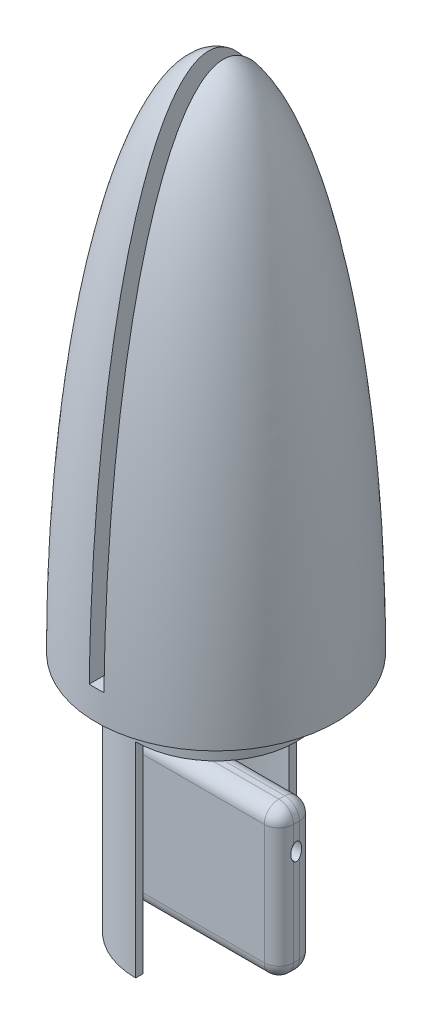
ISO-10303-21;
HEADER;
FILE_DESCRIPTION(('STEP AP214'),'2;1');
FILE_NAME('part.step','',(''),(''),'','','');
FILE_SCHEMA(('AUTOMOTIVE_DESIGN { 1 0 10303 214 1 1 1 1 }'));
ENDSEC;
DATA;
#1=APPLICATION_CONTEXT('core data for automotive mechanical design processes');
#2=APPLICATION_PROTOCOL_DEFINITION('international standard','automotive_design',2000,#1);
#3=PRODUCT_CONTEXT('',#1,'mechanical');
#4=PRODUCT('Part','Part','',(#3));
#5=PRODUCT_RELATED_PRODUCT_CATEGORY('part','',(#4));
#6=PRODUCT_DEFINITION_FORMATION('','',#4);
#7=PRODUCT_DEFINITION_CONTEXT('part definition',#1,'design');
#8=PRODUCT_DEFINITION('design','',#6,#7);
#9=PRODUCT_DEFINITION_SHAPE('','',#8);
#10=(LENGTH_UNIT() NAMED_UNIT(*) SI_UNIT(.MILLI.,.METRE.));
#11=(NAMED_UNIT(*) PLANE_ANGLE_UNIT() SI_UNIT($,.RADIAN.));
#12=(NAMED_UNIT(*) SI_UNIT($,.STERADIAN.) SOLID_ANGLE_UNIT());
#13=UNCERTAINTY_MEASURE_WITH_UNIT(LENGTH_MEASURE(1.E-05),#10,'distance_accuracy_value','');
#14=(GEOMETRIC_REPRESENTATION_CONTEXT(3) GLOBAL_UNCERTAINTY_ASSIGNED_CONTEXT((#13)) GLOBAL_UNIT_ASSIGNED_CONTEXT((#10,
#11,#12)) REPRESENTATION_CONTEXT('',''));
#15=CARTESIAN_POINT('',(0.,0.,0.));
#16=DIRECTION('',(0.,0.,1.));
#17=DIRECTION('',(1.,0.,0.));
#18=AXIS2_PLACEMENT_3D('',#15,#16,#17);
#19=CARTESIAN_POINT('',(5.5,-4.8,0.199999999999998));
#20=DIRECTION('',(1.,0.,0.));
#21=DIRECTION('',(0.,0.,-1.));
#22=AXIS2_PLACEMENT_3D('',#19,#20,#21);
#23=PLANE('',#22);
#24=CARTESIAN_POINT('',(5.5,-6.5,0.));
#25=DIRECTION('',(1.,0.,0.));
#26=DIRECTION('',(0.,1.,0.));
#27=AXIS2_PLACEMENT_3D('',#24,#25,#26);
#28=ELLIPSE('',#27,0.6,0.368251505);
#29=CARTESIAN_POINT('',(5.5,-7.00379806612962,0.199999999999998));
#30=VERTEX_POINT('',#29);
#31=CARTESIAN_POINT('',(5.5,-7.00379806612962,-0.200000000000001));
#32=VERTEX_POINT('',#31);
#33=EDGE_CURVE('E242',#30,#32,#28,.T.);
#34=ORIENTED_EDGE('',*,*,#33,.F.);
#35=DIRECTION('',(0.,-1.,0.));
#36=VECTOR('',#35,1.);
#37=CARTESIAN_POINT('',(5.5,-13.,0.199999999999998));
#38=LINE('',#37,#36);
#39=CARTESIAN_POINT('',(5.5,-13.,0.199999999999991));
#40=VERTEX_POINT('',#39);
#41=EDGE_CURVE('E429',#30,#40,#38,.T.);
#42=ORIENTED_EDGE('',*,*,#41,.T.);
#43=DIRECTION('',(0.,0.,-1.));
#44=VECTOR('',#43,1.);
#45=CARTESIAN_POINT('',(5.5,-13.,-0.199999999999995));
#46=LINE('',#45,#44);
#47=CARTESIAN_POINT('',(5.5,-13.,-0.200000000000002));
#48=VERTEX_POINT('',#47);
#49=EDGE_CURVE('E426',#40,#48,#46,.T.);
#50=ORIENTED_EDGE('',*,*,#49,.T.);
#51=DIRECTION('',(0.,1.,0.));
#52=VECTOR('',#51,1.);
#53=CARTESIAN_POINT('',(5.5,-4.80000000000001,-0.200000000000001));
#54=LINE('',#53,#52);
#55=EDGE_CURVE('E421',#48,#32,#54,.T.);
#56=ORIENTED_EDGE('',*,*,#55,.T.);
#57=EDGE_LOOP('',(#34,#42,#50,#56));
#58=FACE_BOUND('',#57,.T.);
#59=ADVANCED_FACE('F26',(#58),#23,.T.);
#60=CARTESIAN_POINT('',(0.,-14.,0.));
#61=DIRECTION('',(0.,1.,0.));
#62=DIRECTION('',(0.,0.,1.));
#63=AXIS2_PLACEMENT_3D('',#60,#61,#62);
#64=CYLINDRICAL_SURFACE('',#63,5.);
#65=CARTESIAN_POINT('',(-4.85386443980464,-4.8,1.2));
#66=CARTESIAN_POINT('',(-4.8538656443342,-4.85523905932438,1.19999790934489));
#67=CARTESIAN_POINT('',(-4.85500712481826,-4.9105039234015,1.19540668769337));
#68=CARTESIAN_POINT('',(-4.85945643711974,-5.01946077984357,1.17718635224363));
#69=CARTESIAN_POINT('',(-4.86276601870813,-5.07315146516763,1.16354993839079));
#70=CARTESIAN_POINT('',(-4.87120342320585,-5.17735852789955,1.12770275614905));
#71=CARTESIAN_POINT('',(-4.87632897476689,-5.22787877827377,1.10550269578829));
#72=CARTESIAN_POINT('',(-4.88789181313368,-5.3244703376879,1.05319885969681));
#73=CARTESIAN_POINT('',(-4.89432906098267,-5.3705417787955,1.02309531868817));
#74=CARTESIAN_POINT('',(-4.90803139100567,-5.45784050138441,0.955219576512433));
#75=CARTESIAN_POINT('',(-4.91530911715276,-5.49896752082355,0.917320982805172));
#76=CARTESIAN_POINT('',(-4.92992414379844,-5.57434394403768,0.83521490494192));
#77=CARTESIAN_POINT('',(-4.93726145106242,-5.60859255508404,0.7910066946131));
#78=CARTESIAN_POINT('',(-4.95146320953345,-5.66980007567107,0.696650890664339));
#79=CARTESIAN_POINT('',(-4.95831769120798,-5.69662738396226,0.646416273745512));
#80=CARTESIAN_POINT('',(-4.97081490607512,-5.7414163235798,0.541996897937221));
#81=CARTESIAN_POINT('',(-4.97645772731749,-5.75937859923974,0.487812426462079));
#82=CARTESIAN_POINT('',(-4.98601996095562,-5.78570182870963,0.377657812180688));
#83=CARTESIAN_POINT('',(-4.98995801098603,-5.79416831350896,0.321714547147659));
#84=CARTESIAN_POINT('',(-4.99594366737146,-5.80154876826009,0.20910337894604));
#85=CARTESIAN_POINT('',(-4.99799152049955,-5.80046398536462,0.152435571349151));
#86=CARTESIAN_POINT('',(-5.00013428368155,-5.78885772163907,0.0411659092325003));
#87=CARTESIAN_POINT('',(-5.00026670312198,-5.77852170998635,-0.013454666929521));
#88=CARTESIAN_POINT('',(-4.99883993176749,-5.74896395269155,-0.120210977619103));
#89=CARTESIAN_POINT('',(-4.99728074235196,-5.72974221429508,-0.172346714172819));
#90=CARTESIAN_POINT('',(-4.99281439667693,-5.68299719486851,-0.272624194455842));
#91=CARTESIAN_POINT('',(-4.98990853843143,-5.65548191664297,-0.320769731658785));
#92=CARTESIAN_POINT('',(-4.98322073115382,-5.5929212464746,-0.411823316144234));
#93=CARTESIAN_POINT('',(-4.97943870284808,-5.55787517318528,-0.454730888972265));
#94=CARTESIAN_POINT('',(-4.97148755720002,-5.48064876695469,-0.534747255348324));
#95=CARTESIAN_POINT('',(-4.96731360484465,-5.43837197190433,-0.571762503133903));
#96=CARTESIAN_POINT('',(-4.95921421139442,-5.34820819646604,-0.638214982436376));
#97=CARTESIAN_POINT('',(-4.95528877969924,-5.30032100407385,-0.667651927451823));
#98=CARTESIAN_POINT('',(-4.94820615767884,-5.19994119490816,-0.718273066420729));
#99=CARTESIAN_POINT('',(-4.94505379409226,-5.14742229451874,-0.739405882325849));
#100=CARTESIAN_POINT('',(-4.93998795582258,-5.03952047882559,-0.772529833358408));
#101=CARTESIAN_POINT('',(-4.93807438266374,-4.98413779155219,-0.784521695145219));
#102=CARTESIAN_POINT('',(-4.93576521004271,-4.872677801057,-0.798921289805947));
#103=CARTESIAN_POINT('',(-4.93535449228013,-4.81661314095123,-0.801424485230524));
#104=CARTESIAN_POINT('',(-4.93606547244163,-4.70486467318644,-0.797033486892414));
#105=CARTESIAN_POINT('',(-4.93718711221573,-4.64918085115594,-0.790139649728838));
#106=CARTESIAN_POINT('',(-4.94079588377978,-4.54016215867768,-0.767246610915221));
#107=CARTESIAN_POINT('',(-4.94327371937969,-4.48681393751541,-0.751309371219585));
#108=CARTESIAN_POINT('',(-4.94925393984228,-4.38354253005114,-0.710845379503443));
#109=CARTESIAN_POINT('',(-4.95275639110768,-4.33361956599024,-0.686318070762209));
#110=CARTESIAN_POINT('',(-4.96034840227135,-4.23812768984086,-0.629110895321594));
#111=CARTESIAN_POINT('',(-4.96444290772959,-4.19260146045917,-0.596360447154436));
#112=CARTESIAN_POINT('',(-4.97262988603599,-4.10764860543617,-0.523721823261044));
#113=CARTESIAN_POINT('',(-4.97672235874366,-4.06822235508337,-0.483833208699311));
#114=CARTESIAN_POINT('',(-4.98435249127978,-3.99625266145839,-0.397635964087));
#115=CARTESIAN_POINT('',(-4.98788517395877,-3.9637701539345,-0.351275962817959));
#116=CARTESIAN_POINT('',(-4.99379885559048,-3.90705570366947,-0.253690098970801));
#117=CARTESIAN_POINT('',(-4.99617993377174,-3.88282319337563,-0.202464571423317));
#118=CARTESIAN_POINT('',(-4.99933279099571,-3.8435064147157,-0.0970777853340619));
#119=CARTESIAN_POINT('',(-5.00011846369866,-3.82834398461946,-0.0429461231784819));
#120=CARTESIAN_POINT('',(-4.99985240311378,-3.80729146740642,0.0670845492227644));
#121=CARTESIAN_POINT('',(-4.99880084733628,-3.80140048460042,0.122983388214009));
#122=CARTESIAN_POINT('',(-4.99481989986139,-3.79905879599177,0.234150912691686));
#123=CARTESIAN_POINT('',(-4.99191605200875,-3.80248171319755,0.289417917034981));
#124=CARTESIAN_POINT('',(-4.98439310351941,-3.81835356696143,0.398517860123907));
#125=CARTESIAN_POINT('',(-4.97977395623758,-3.83080274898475,0.452350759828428));
#126=CARTESIAN_POINT('',(-4.96911865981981,-3.86440308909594,0.55736989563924));
#127=CARTESIAN_POINT('',(-4.96307565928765,-3.8855967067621,0.608541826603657));
#128=CARTESIAN_POINT('',(-4.9500663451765,-3.93606046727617,0.706606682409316));
#129=CARTESIAN_POINT('',(-4.94309992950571,-3.96533150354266,0.753499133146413));
#130=CARTESIAN_POINT('',(-4.9286846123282,-4.03182898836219,0.842706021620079));
#131=CARTESIAN_POINT('',(-4.92122875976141,-4.06920580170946,0.884907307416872));
#132=CARTESIAN_POINT('',(-4.90664782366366,-4.15055203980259,0.962480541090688));
#133=CARTESIAN_POINT('',(-4.89952281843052,-4.19452301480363,0.997850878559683));
#134=CARTESIAN_POINT('',(-4.88623481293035,-4.28827113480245,1.06101961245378));
#135=CARTESIAN_POINT('',(-4.88008014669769,-4.33809277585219,1.08875379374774));
#136=CARTESIAN_POINT('',(-4.86944248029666,-4.44184307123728,1.13538841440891));
#137=CARTESIAN_POINT('',(-4.86495783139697,-4.49576761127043,1.15429757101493));
#138=CARTESIAN_POINT('',(-4.8590367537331,-4.59153453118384,1.17892907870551));
#139=CARTESIAN_POINT('',(-4.85710794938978,-4.63280326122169,1.18681583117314));
#140=CARTESIAN_POINT('',(-4.85452136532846,-4.71604304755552,1.19735195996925));
#141=CARTESIAN_POINT('',(-4.8538635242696,-4.75801406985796,1.20000158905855));
#142=CARTESIAN_POINT('',(-4.85386443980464,-4.8,1.2));
#143=B_SPLINE_CURVE_WITH_KNOTS('',3,(#65,#66,#67,#68,#69,#70,#71,#72,#73,#74,#75,#76,#77,#78,
#79,#80,#81,#82,#83,#84,#85,#86,#87,#88,#89,#90,#91,#92,#93,#94,#95,#96,#97,#98,#99,#100,#101,
#102,#103,#104,#105,#106,#107,#108,#109,#110,#111,#112,#113,#114,#115,#116,#117,#118,#119,#120,
#121,#122,#123,#124,#125,#126,#127,#128,#129,#130,#131,#132,#133,#134,#135,#136,#137,#138,#139,
#140,#141,#142),.UNSPECIFIED.,.T.,.F.,(4,2,2,2,2,2,2,2,2,2,2,2,2,2,2,2,2,2,2,2,2,2,2,2,2,2,2,2,
2,2,2,2,2,2,2,2,2,2,4),(0.,0.165562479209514,0.331258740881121,0.496748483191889,
0.662233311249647,0.830649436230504,0.999084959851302,1.17033957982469,1.34158175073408,
1.51090136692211,1.68019887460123,1.84617648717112,2.01215396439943,2.17797179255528,
2.3438046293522,2.51205244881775,2.68030662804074,2.84958600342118,3.01885192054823,
3.18641031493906,3.35396235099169,3.52038001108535,3.68680845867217,3.85471739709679,
4.02263666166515,4.19197397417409,4.36129963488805,4.52914427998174,4.69697270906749,
4.86253532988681,5.02810245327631,5.19448314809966,5.36088225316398,5.53068219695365,
5.70052212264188,5.87174946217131,6.04280730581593,6.16865358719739,6.29449379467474),.UNSPECIFIED.);
#144=CARTESIAN_POINT('',(-4.99599839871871,-3.8,0.199999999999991));
#145=VERTEX_POINT('',#144);
#146=CARTESIAN_POINT('',(-4.85386443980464,-4.80000000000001,1.2));
#147=VERTEX_POINT('',#146);
#148=EDGE_CURVE('E318',#145,#147,#143,.T.);
#149=ORIENTED_EDGE('',*,*,#148,.F.);
#150=CARTESIAN_POINT('',(0.,-3.8,0.));
#151=DIRECTION('',(0.,1.,0.));
#152=DIRECTION('',(0.,0.,1.));
#153=AXIS2_PLACEMENT_3D('',#150,#151,#152);
#154=CIRCLE('',#153,5.);
#155=CARTESIAN_POINT('',(-4.9749371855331,-3.8,0.5));
#156=VERTEX_POINT('',#155);
#157=EDGE_CURVE('E401',#156,#145,#154,.F.);
#158=ORIENTED_EDGE('',*,*,#157,.F.);
#159=DIRECTION('',(0.,1.,0.));
#160=VECTOR('',#159,1.);
#161=CARTESIAN_POINT('',(-4.9749371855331,-14.,0.5));
#162=LINE('',#161,#160);
#163=CARTESIAN_POINT('',(-4.9749371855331,0.,0.5));
#164=VERTEX_POINT('',#163);
#165=EDGE_CURVE('E408',#164,#156,#162,.F.);
#166=ORIENTED_EDGE('',*,*,#165,.F.);
#167=CARTESIAN_POINT('',(0.,0.,0.));
#168=DIRECTION('',(0.,1.,0.));
#169=DIRECTION('',(0.,0.,1.));
#170=AXIS2_PLACEMENT_3D('',#167,#168,#169);
#171=CIRCLE('',#170,5.);
#172=CARTESIAN_POINT('',(0.,0.,5.));
#173=VERTEX_POINT('',#172);
#174=EDGE_CURVE('E385',#164,#173,#171,.T.);
#175=ORIENTED_EDGE('',*,*,#174,.T.);
#176=DIRECTION('',(0.,1.,0.));
#177=VECTOR('',#176,1.);
#178=CARTESIAN_POINT('',(0.,-14.,5.));
#179=LINE('',#178,#177);
#180=CARTESIAN_POINT('',(0.,-14.,5.));
#181=VERTEX_POINT('',#180);
#182=EDGE_CURVE('E511',#181,#173,#179,.T.);
#183=ORIENTED_EDGE('',*,*,#182,.F.);
#184=CARTESIAN_POINT('',(0.,-14.,0.));
#185=DIRECTION('',(0.,1.,0.));
#186=DIRECTION('',(0.,0.,1.));
#187=AXIS2_PLACEMENT_3D('',#184,#185,#186);
#188=CIRCLE('',#187,5.);
#189=CARTESIAN_POINT('',(-4.99599839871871,-14.,0.199999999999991));
#190=VERTEX_POINT('',#189);
#191=EDGE_CURVE('E398',#190,#181,#188,.T.);
#192=ORIENTED_EDGE('',*,*,#191,.F.);
#193=CARTESIAN_POINT('',(-4.99599839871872,-14.,0.199999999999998));
#194=CARTESIAN_POINT('',(-4.99821273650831,-13.9999980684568,0.144662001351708));
#195=CARTESIAN_POINT('',(-4.99950121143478,-13.9953913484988,0.0892628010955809));
#196=CARTESIAN_POINT('',(-5.00025924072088,-13.977064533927,-0.0200464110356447));
#197=CARTESIAN_POINT('',(-4.99972751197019,-13.9633380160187,-0.0739553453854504));
#198=CARTESIAN_POINT('',(-4.99708062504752,-13.9271806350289,-0.178684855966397));
#199=CARTESIAN_POINT('',(-4.99496660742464,-13.9047560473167,-0.229507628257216));
#200=CARTESIAN_POINT('',(-4.98955341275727,-13.8518540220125,-0.326693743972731));
#201=CARTESIAN_POINT('',(-4.98625430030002,-13.8213770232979,-0.373057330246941));
#202=CARTESIAN_POINT('',(-4.97894672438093,-13.7529193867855,-0.46047055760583));
#203=CARTESIAN_POINT('',(-4.97493225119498,-13.7148748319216,-0.501469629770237));
#204=CARTESIAN_POINT('',(-4.96679014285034,-13.6324994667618,-0.576563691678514));
#205=CARTESIAN_POINT('',(-4.96266249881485,-13.5881681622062,-0.610658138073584));
#206=CARTESIAN_POINT('',(-4.95482073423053,-13.4939007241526,-0.671342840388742));
#207=CARTESIAN_POINT('',(-4.9511116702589,-13.4439082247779,-0.697846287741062));
#208=CARTESIAN_POINT('',(-4.94467706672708,-13.3401197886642,-0.742072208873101));
#209=CARTESIAN_POINT('',(-4.94195147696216,-13.2863240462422,-0.759795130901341));
#210=CARTESIAN_POINT('',(-4.93787655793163,-13.1768081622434,-0.78584324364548));
#211=CARTESIAN_POINT('',(-4.93651871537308,-13.1211021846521,-0.794226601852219));
#212=CARTESIAN_POINT('',(-4.93533774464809,-13.0090590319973,-0.801533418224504));
#213=CARTESIAN_POINT('',(-4.93551450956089,-12.9527219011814,-0.800457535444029));
#214=CARTESIAN_POINT('',(-4.93736805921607,-12.8416299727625,-0.788941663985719));
#215=CARTESIAN_POINT('',(-4.93902934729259,-12.7868648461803,-0.778598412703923));
#216=CARTESIAN_POINT('',(-4.94360494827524,-12.679856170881,-0.748994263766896));
#217=CARTESIAN_POINT('',(-4.94651931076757,-12.6276127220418,-0.729733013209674));
#218=CARTESIAN_POINT('',(-4.95322356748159,-12.5268533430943,-0.682743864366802));
#219=CARTESIAN_POINT('',(-4.95701741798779,-12.4783556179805,-0.654977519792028));
#220=CARTESIAN_POINT('',(-4.96495732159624,-12.3866674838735,-0.591785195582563));
#221=CARTESIAN_POINT('',(-4.96910340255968,-12.3434774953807,-0.556358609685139));
#222=CARTESIAN_POINT('',(-4.97721944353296,-12.263125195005,-0.478369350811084));
#223=CARTESIAN_POINT('',(-4.98118690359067,-12.2260360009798,-0.435731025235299));
#224=CARTESIAN_POINT('',(-4.9883068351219,-12.1595297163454,-0.344778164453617));
#225=CARTESIAN_POINT('',(-4.99145932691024,-12.1301124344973,-0.296463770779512));
#226=CARTESIAN_POINT('',(-4.9964232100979,-12.0798917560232,-0.195676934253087));
#227=CARTESIAN_POINT('',(-4.99823891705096,-12.0590607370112,-0.143218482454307));
#228=CARTESIAN_POINT('',(-5.00016357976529,-12.0265042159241,-0.035520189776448));
#229=CARTESIAN_POINT('',(-5.00027272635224,-12.0147776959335,0.0197193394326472));
#230=CARTESIAN_POINT('',(-4.99859860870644,-12.0008781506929,0.130522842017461));
#231=CARTESIAN_POINT('',(-4.99684342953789,-11.9985658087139,0.186069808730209));
#232=CARTESIAN_POINT('',(-4.99149688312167,-12.0031472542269,0.296690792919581));
#233=CARTESIAN_POINT('',(-4.98790554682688,-12.010040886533,0.351764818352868));
#234=CARTESIAN_POINT('',(-4.97911033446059,-12.032757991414,0.45977349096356));
#235=CARTESIAN_POINT('',(-4.97390998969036,-12.048561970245,0.512712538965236));
#236=CARTESIAN_POINT('',(-4.96228155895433,-12.0885905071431,0.615160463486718));
#237=CARTESIAN_POINT('',(-4.95585333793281,-12.112815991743,0.664668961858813));
#238=CARTESIAN_POINT('',(-4.94216741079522,-12.1695079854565,0.759826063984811));
#239=CARTESIAN_POINT('',(-4.93489684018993,-12.2021151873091,0.8053889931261));
#240=CARTESIAN_POINT('',(-4.92026237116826,-12.2744589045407,0.890440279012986));
#241=CARTESIAN_POINT('',(-4.9128984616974,-12.3141962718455,0.929927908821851));
#242=CARTESIAN_POINT('',(-4.89864890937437,-12.4004043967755,1.00230876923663));
#243=CARTESIAN_POINT('',(-4.89177206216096,-12.4469669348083,1.03509459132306));
#244=CARTESIAN_POINT('',(-4.8793053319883,-12.5451074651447,1.09235612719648));
#245=CARTESIAN_POINT('',(-4.8737153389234,-12.5966850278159,1.1168325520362));
#246=CARTESIAN_POINT('',(-4.8644653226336,-12.7027485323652,1.15645524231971));
#247=CARTESIAN_POINT('',(-4.86078245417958,-12.7571910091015,1.17171233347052));
#248=CARTESIAN_POINT('',(-4.85563971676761,-12.8679661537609,1.1928468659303));
#249=CARTESIAN_POINT('',(-4.85417943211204,-12.9242984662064,1.19872606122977));
#250=CARTESIAN_POINT('',(-4.85364824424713,-13.0356950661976,1.2008742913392));
#251=CARTESIAN_POINT('',(-4.85451656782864,-13.0907545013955,1.19738775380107));
#252=CARTESIAN_POINT('',(-4.85842172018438,-13.1994760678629,1.18144175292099));
#253=CARTESIAN_POINT('',(-4.86145851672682,-13.2531382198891,1.16898242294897));
#254=CARTESIAN_POINT('',(-4.86937517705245,-13.3573954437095,1.13555129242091));
#255=CARTESIAN_POINT('',(-4.8742489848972,-13.4079999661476,1.11460744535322));
#256=CARTESIAN_POINT('',(-4.88536288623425,-13.5050055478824,1.06483654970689));
#257=CARTESIAN_POINT('',(-4.89160313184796,-13.5514061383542,1.03600862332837));
#258=CARTESIAN_POINT('',(-4.90502563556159,-13.6398708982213,0.970497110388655));
#259=CARTESIAN_POINT('',(-4.91222667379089,-13.6818066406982,0.933643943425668));
#260=CARTESIAN_POINT('',(-4.92678445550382,-13.758974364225,0.853493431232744));
#261=CARTESIAN_POINT('',(-4.93414124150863,-13.7942044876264,0.810194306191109));
#262=CARTESIAN_POINT('',(-4.94848812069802,-13.8576016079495,0.717430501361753));
#263=CARTESIAN_POINT('',(-4.95546882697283,-13.8856247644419,0.667865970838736));
#264=CARTESIAN_POINT('',(-4.96829099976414,-13.932887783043,0.56460752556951));
#265=CARTESIAN_POINT('',(-4.97413344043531,-13.9521351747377,0.510917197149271));
#266=CARTESIAN_POINT('',(-4.98298213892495,-13.9777188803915,0.414298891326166));
#267=CARTESIAN_POINT('',(-4.98633259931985,-13.9860548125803,0.37192071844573));
#268=CARTESIAN_POINT('',(-4.99197627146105,-13.9971959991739,0.286374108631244));
#269=CARTESIAN_POINT('',(-4.99426953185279,-14.0000015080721,0.243205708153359));
#270=CARTESIAN_POINT('',(-4.99599839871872,-14.,0.199999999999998));
#271=B_SPLINE_CURVE_WITH_KNOTS('',3,(#193,#194,#195,#196,#197,#198,#199,#200,#201,#202,#203,
#204,#205,#206,#207,#208,#209,#210,#211,#212,#213,#214,#215,#216,#217,#218,#219,#220,#221,#222,
#223,#224,#225,#226,#227,#228,#229,#230,#231,#232,#233,#234,#235,#236,#237,#238,#239,#240,#241,
#242,#243,#244,#245,#246,#247,#248,#249,#250,#251,#252,#253,#254,#255,#256,#257,#258,#259,#260,
#261,#262,#263,#264,#265,#266,#267,#268,#269,#270),.UNSPECIFIED.,.T.,.F.,(4,2,2,2,2,2,2,2,2,2,2,
2,2,2,2,2,2,2,2,2,2,2,2,2,2,2,2,2,2,2,2,2,2,2,2,2,2,2,4),(0.,0.165990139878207,
0.332097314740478,0.498084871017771,0.664063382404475,0.831508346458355,0.998966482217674,
1.16826943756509,1.3375637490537,1.50579768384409,1.67401989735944,1.84050632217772,
2.00699933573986,2.17425635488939,2.34152661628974,2.51067485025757,2.67981886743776,
2.84841441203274,3.01699110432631,3.18306382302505,3.34913374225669,3.51484174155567,
3.68056797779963,3.84928186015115,4.0180159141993,4.1892724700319,4.36051436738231,
4.52965454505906,4.69876308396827,4.86350137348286,5.02823721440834,5.192434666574,
5.35665040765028,5.52474778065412,5.69289165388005,5.86416858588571,6.03529828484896,
6.16490274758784,6.29450124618),.UNSPECIFIED.);
#272=CARTESIAN_POINT('',(-4.85386443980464,-13.,1.2));
#273=VERTEX_POINT('',#272);
#274=EDGE_CURVE('E354',#273,#190,#271,.T.);
#275=ORIENTED_EDGE('',*,*,#274,.F.);
#276=DIRECTION('',(0.,1.,0.));
#277=VECTOR('',#276,1.);
#278=CARTESIAN_POINT('',(-4.85386443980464,-14.,1.2));
#279=LINE('',#278,#277);
#280=EDGE_CURVE('E414',#147,#273,#279,.F.);
#281=ORIENTED_EDGE('',*,*,#280,.F.);
#282=EDGE_LOOP('',(#149,#158,#166,#175,#183,#192,#275,#281));
#283=FACE_BOUND('',#282,.T.);
#284=ADVANCED_FACE('F323',(#283),#64,.F.);
#285=CARTESIAN_POINT('',(-4.99599839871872,-14.,-0.200000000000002));
#286=CARTESIAN_POINT('',(-4.99376034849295,-13.9999978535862,-0.255879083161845));
#287=CARTESIAN_POINT('',(-4.99057615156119,-13.995300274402,-0.311747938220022));
#288=CARTESIAN_POINT('',(-4.98248076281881,-13.9766850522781,-0.421829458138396));
#289=CARTESIAN_POINT('',(-4.97756804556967,-13.962759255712,-0.476040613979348));
#290=CARTESIAN_POINT('',(-4.96638663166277,-13.9261637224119,-0.581203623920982));
#291=CARTESIAN_POINT('',(-4.96011952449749,-13.9035042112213,-0.632159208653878));
#292=CARTESIAN_POINT('',(-4.9467386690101,-13.8501148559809,-0.729516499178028));
#293=CARTESIAN_POINT('',(-4.93962497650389,-13.819385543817,-0.775918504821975));
#294=CARTESIAN_POINT('',(-4.92505399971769,-13.7501773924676,-0.863626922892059));
#295=CARTESIAN_POINT('',(-4.91759316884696,-13.7115895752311,-0.904846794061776));
#296=CARTESIAN_POINT('',(-4.90311883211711,-13.6279876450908,-0.980256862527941));
#297=CARTESIAN_POINT('',(-4.89610535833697,-13.5829730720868,-1.01444655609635));
#298=CARTESIAN_POINT('',(-4.88317031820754,-13.4874409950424,-1.07499531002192));
#299=CARTESIAN_POINT('',(-4.87725514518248,-13.4368938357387,-1.10130903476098));
#300=CARTESIAN_POINT('',(-4.86717957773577,-13.3319175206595,-1.14501951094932));
#301=CARTESIAN_POINT('',(-4.86301889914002,-13.2774889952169,-1.1624177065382));
#302=CARTESIAN_POINT('',(-4.85696936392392,-13.1675491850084,-1.18743934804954));
#303=CARTESIAN_POINT('',(-4.8550333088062,-13.1120867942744,-1.19526610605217));
#304=CARTESIAN_POINT('',(-4.85348054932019,-13.0006048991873,-1.20155651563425));
#305=CARTESIAN_POINT('',(-4.85386352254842,-12.9445854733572,-1.20002146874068));
#306=CARTESIAN_POINT('',(-4.85687464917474,-12.8347951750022,-1.18777338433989));
#307=CARTESIAN_POINT('',(-4.85945651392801,-12.7810017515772,-1.17724955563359));
#308=CARTESIAN_POINT('',(-4.86653889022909,-12.67596844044,-1.14761891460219));
#309=CARTESIAN_POINT('',(-4.87103951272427,-12.6247287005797,-1.12851160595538));
#310=CARTESIAN_POINT('',(-4.88156586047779,-12.525694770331,-1.08207393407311));
#311=CARTESIAN_POINT('',(-4.88760571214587,-12.4779380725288,-1.05466693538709));
#312=CARTESIAN_POINT('',(-4.90061193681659,-12.3876372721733,-0.992476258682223));
#313=CARTESIAN_POINT('',(-4.90757845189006,-12.3450939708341,-0.957691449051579));
#314=CARTESIAN_POINT('',(-4.92199067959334,-12.2652588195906,-0.880669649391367));
#315=CARTESIAN_POINT('',(-4.92944415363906,-12.2281330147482,-0.838261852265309));
#316=CARTESIAN_POINT('',(-4.94397875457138,-12.1614908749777,-0.747777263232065));
#317=CARTESIAN_POINT('',(-4.95105985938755,-12.1319749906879,-0.69970013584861));
#318=CARTESIAN_POINT('',(-4.96428203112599,-12.0811920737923,-0.598758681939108));
#319=CARTESIAN_POINT('',(-4.97041521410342,-12.0599921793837,-0.545859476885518));
#320=CARTESIAN_POINT('',(-4.98115811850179,-12.0268505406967,-0.437089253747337));
#321=CARTESIAN_POINT('',(-4.98576802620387,-12.0149076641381,-0.381218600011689));
#322=CARTESIAN_POINT('',(-4.99306212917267,-12.0008222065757,-0.269127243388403));
#323=CARTESIAN_POINT('',(-4.99577855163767,-11.9985121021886,-0.212929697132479));
#324=CARTESIAN_POINT('',(-4.99929626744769,-12.0033457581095,-0.100884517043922));
#325=CARTESIAN_POINT('',(-5.00009774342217,-12.0104886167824,-0.0450368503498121));
#326=CARTESIAN_POINT('',(-4.9998846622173,-12.033845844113,0.0638124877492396));
#327=CARTESIAN_POINT('',(-4.99889806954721,-12.0499178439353,0.116844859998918));
#328=CARTESIAN_POINT('',(-4.99544421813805,-12.0905637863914,0.219491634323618));
#329=CARTESIAN_POINT('',(-4.99297690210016,-12.1151380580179,0.269105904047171));
#330=CARTESIAN_POINT('',(-4.98697160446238,-12.1722584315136,0.363845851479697));
#331=CARTESIAN_POINT('',(-4.98342726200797,-12.2048516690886,0.408942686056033));
#332=CARTESIAN_POINT('',(-4.97580590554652,-12.277026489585,0.493096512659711));
#333=CARTESIAN_POINT('',(-4.97172884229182,-12.3166087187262,0.532152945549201));
#334=CARTESIAN_POINT('',(-4.96355432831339,-12.4023080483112,0.603694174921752));
#335=CARTESIAN_POINT('',(-4.95945743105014,-12.4485111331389,0.636076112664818));
#336=CARTESIAN_POINT('',(-4.95187501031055,-12.5457368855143,0.692641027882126));
#337=CARTESIAN_POINT('',(-4.94838948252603,-12.596759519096,0.716824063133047));
#338=CARTESIAN_POINT('',(-4.94251222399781,-12.7022085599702,0.75628945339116));
#339=CARTESIAN_POINT('',(-4.94012062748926,-12.7566353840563,0.77157071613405));
#340=CARTESIAN_POINT('',(-4.93676501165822,-12.8673254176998,0.792759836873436));
#341=CARTESIAN_POINT('',(-4.93580087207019,-12.9235884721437,0.798668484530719));
#342=CARTESIAN_POINT('',(-4.93543658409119,-13.0356486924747,0.800916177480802));
#343=CARTESIAN_POINT('',(-4.93601824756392,-13.0914435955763,0.79736650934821));
#344=CARTESIAN_POINT('',(-4.93862711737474,-13.2016312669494,0.781043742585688));
#345=CARTESIAN_POINT('',(-4.94065432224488,-13.2560240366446,0.768270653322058));
#346=CARTESIAN_POINT('',(-4.94587398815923,-13.3617902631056,0.733913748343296));
#347=CARTESIAN_POINT('',(-4.94906454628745,-13.4131684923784,0.712344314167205));
#348=CARTESIAN_POINT('',(-4.95618075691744,-13.5116002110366,0.661014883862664));
#349=CARTESIAN_POINT('',(-4.96010645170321,-13.5586534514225,0.631254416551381));
#350=CARTESIAN_POINT('',(-4.96820728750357,-13.6476740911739,0.563980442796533));
#351=CARTESIAN_POINT('',(-4.97238475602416,-13.6895776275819,0.526382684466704));
#352=CARTESIAN_POINT('',(-4.98035657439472,-13.766519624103,0.444668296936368));
#353=CARTESIAN_POINT('',(-4.98415085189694,-13.8015567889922,0.400550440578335));
#354=CARTESIAN_POINT('',(-4.99079829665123,-13.8638875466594,0.306831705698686));
#355=CARTESIAN_POINT('',(-4.99364772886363,-13.8911503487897,0.257210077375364));
#356=CARTESIAN_POINT('',(-4.997891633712,-13.9369209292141,0.15405770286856));
#357=CARTESIAN_POINT('',(-4.99928746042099,-13.9554368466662,0.100530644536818));
#358=CARTESIAN_POINT('',(-5.00015858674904,-13.9794924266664,0.00570179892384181));
#359=CARTESIAN_POINT('',(-5.00004581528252,-13.9871732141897,-0.0350668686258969));
#360=CARTESIAN_POINT('',(-4.99879446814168,-13.9974277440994,-0.117225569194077));
#361=CARTESIAN_POINT('',(-4.99765591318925,-14.000001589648,-0.158615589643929));
#362=CARTESIAN_POINT('',(-4.99599839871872,-14.,-0.200000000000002));
#363=B_SPLINE_CURVE_WITH_KNOTS('',3,(#285,#286,#287,#288,#289,#290,#291,#292,#293,#294,#295,
#296,#297,#298,#299,#300,#301,#302,#303,#304,#305,#306,#307,#308,#309,#310,#311,#312,#313,#314,
#315,#316,#317,#318,#319,#320,#321,#322,#323,#324,#325,#326,#327,#328,#329,#330,#331,#332,#333,
#334,#335,#336,#337,#338,#339,#340,#341,#342,#343,#344,#345,#346,#347,#348,#349,#350,#351,#352,
#353,#354,#355,#356,#357,#358,#359,#360,#361,#362),.UNSPECIFIED.,.T.,.F.,(4,2,2,2,2,2,2,2,2,2,2,
2,2,2,2,2,2,2,2,2,2,2,2,2,2,2,2,2,2,2,2,2,2,2,2,2,2,2,4),(0.,0.167618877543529,
0.335386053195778,0.502957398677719,0.670517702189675,0.840582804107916,1.01066008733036,
1.18169833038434,1.35270885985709,1.52001997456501,1.68730782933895,1.85115877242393,
2.01501919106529,2.18044130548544,2.34588881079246,2.51565452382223,2.68543028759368,
2.85654981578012,3.02764841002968,3.19575869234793,3.36385294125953,3.52934092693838,
3.69483531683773,3.86132675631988,4.02783359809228,4.19674091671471,4.36564704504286,
4.53457389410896,4.70348651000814,4.87042050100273,5.0373543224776,5.20401630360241,
5.37068787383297,5.53925325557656,5.70785040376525,5.8771062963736,6.04620438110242,
6.17034651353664,6.29448613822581),.UNSPECIFIED.);
#364=CARTESIAN_POINT('',(-4.99599839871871,-14.,-0.199999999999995));
#365=VERTEX_POINT('',#364);
#366=CARTESIAN_POINT('',(-4.85386443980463,-13.,-1.2));
#367=VERTEX_POINT('',#366);
#368=EDGE_CURVE('E349',#365,#367,#363,.T.);
#369=ORIENTED_EDGE('',*,*,#368,.F.);
#370=CARTESIAN_POINT('',(0.,-14.,-5.));
#371=VERTEX_POINT('',#370);
#372=EDGE_CURVE('E391',#371,#365,#188,.T.);
#373=ORIENTED_EDGE('',*,*,#372,.F.);
#374=DIRECTION('',(0.,1.,0.));
#375=VECTOR('',#374,1.);
#376=CARTESIAN_POINT('',(0.,-14.,-5.));
#377=LINE('',#376,#375);
#378=CARTESIAN_POINT('',(0.,0.,-5.));
#379=VERTEX_POINT('',#378);
#380=EDGE_CURVE('E526',#371,#379,#377,.T.);
#381=ORIENTED_EDGE('',*,*,#380,.T.);
#382=CARTESIAN_POINT('',(-4.9749371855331,0.,-0.499999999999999));
#383=VERTEX_POINT('',#382);
#384=EDGE_CURVE('E386',#379,#383,#171,.T.);
#385=ORIENTED_EDGE('',*,*,#384,.T.);
#386=DIRECTION('',(0.,1.,0.));
#387=VECTOR('',#386,1.);
#388=CARTESIAN_POINT('',(-4.9749371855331,-14.,-0.500000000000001));
#389=LINE('',#388,#387);
#390=CARTESIAN_POINT('',(-4.9749371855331,-3.8,-0.5));
#391=VERTEX_POINT('',#390);
#392=EDGE_CURVE('E404',#391,#383,#389,.T.);
#393=ORIENTED_EDGE('',*,*,#392,.F.);
#394=CARTESIAN_POINT('',(-4.99599839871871,-3.8,-0.199999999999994));
#395=VERTEX_POINT('',#394);
#396=EDGE_CURVE('E405',#395,#391,#154,.F.);
#397=ORIENTED_EDGE('',*,*,#396,.F.);
#398=CARTESIAN_POINT('',(-4.93558507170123,-4.8,0.799999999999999));
#399=CARTESIAN_POINT('',(-4.93558608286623,-4.85582070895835,0.799997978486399));
#400=CARTESIAN_POINT('',(-4.93635217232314,-4.91166733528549,0.795310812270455));
#401=CARTESIAN_POINT('',(-4.93931477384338,-5.02178871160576,0.776695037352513));
#402=CARTESIAN_POINT('',(-4.94151242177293,-5.07606217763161,0.762759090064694));
#403=CARTESIAN_POINT('',(-4.94703507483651,-5.18143605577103,0.726075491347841));
#404=CARTESIAN_POINT('',(-4.95035920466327,-5.23253889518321,0.703334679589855));
#405=CARTESIAN_POINT('',(-4.95768311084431,-5.33020529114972,0.649698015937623));
#406=CARTESIAN_POINT('',(-4.9616828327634,-5.3767692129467,0.618802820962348));
#407=CARTESIAN_POINT('',(-4.96984573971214,-5.46447338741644,0.549418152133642));
#408=CARTESIAN_POINT('',(-4.97401001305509,-5.50556496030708,0.510867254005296));
#409=CARTESIAN_POINT('',(-4.98187601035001,-5.58072498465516,0.427393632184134));
#410=CARTESIAN_POINT('',(-4.98557772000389,-5.61479321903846,0.382470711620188));
#411=CARTESIAN_POINT('',(-4.9919624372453,-5.67500900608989,0.287374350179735));
#412=CARTESIAN_POINT('',(-4.99464296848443,-5.70113727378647,0.23718851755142));
#413=CARTESIAN_POINT('',(-4.99849958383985,-5.74458205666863,0.133084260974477));
#414=CARTESIAN_POINT('',(-4.9996758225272,-5.76189947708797,0.079166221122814));
#415=CARTESIAN_POINT('',(-5.00020372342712,-5.78702852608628,-0.0300780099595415));
#416=CARTESIAN_POINT('',(-4.99957995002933,-5.79496606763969,-0.0853751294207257));
#417=CARTESIAN_POINT('',(-4.99644760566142,-5.80154036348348,-0.196463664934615));
#418=CARTESIAN_POINT('',(-4.99393914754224,-5.80017767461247,-0.252255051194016));
#419=CARTESIAN_POINT('',(-4.9871610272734,-5.78828397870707,-0.362268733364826));
#420=CARTESIAN_POINT('',(-4.98290608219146,-5.77782878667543,-0.416500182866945));
#421=CARTESIAN_POINT('',(-4.97292116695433,-5.74820435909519,-0.522384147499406));
#422=CARTESIAN_POINT('',(-4.96719108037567,-5.72903443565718,-0.574036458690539));
#423=CARTESIAN_POINT('',(-4.9546163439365,-5.68224620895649,-0.674057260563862));
#424=CARTESIAN_POINT('',(-4.94775795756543,-5.65451954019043,-0.72237329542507));
#425=CARTESIAN_POINT('',(-4.93356139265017,-5.59148546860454,-0.813702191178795));
#426=CARTESIAN_POINT('',(-4.92622314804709,-5.55617702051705,-0.85671431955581));
#427=CARTESIAN_POINT('',(-4.91157553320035,-5.47816016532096,-0.937085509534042));
#428=CARTESIAN_POINT('',(-4.90426945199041,-5.43532212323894,-0.974319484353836));
#429=CARTESIAN_POINT('',(-4.89053513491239,-5.34387681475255,-1.041072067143));
#430=CARTESIAN_POINT('',(-4.88410689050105,-5.29526960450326,-1.07059075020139));
#431=CARTESIAN_POINT('',(-4.87279754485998,-5.19378068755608,-1.1209420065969));
#432=CARTESIAN_POINT('',(-4.86791129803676,-5.14091395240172,-1.14180354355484));
#433=CARTESIAN_POINT('',(-4.86017510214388,-5.03227687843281,-1.17429986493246));
#434=CARTESIAN_POINT('',(-4.85732475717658,-4.97650710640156,-1.18593644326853));
#435=CARTESIAN_POINT('',(-4.85401578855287,-4.86517920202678,-1.19940730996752));
#436=CARTESIAN_POINT('',(-4.85349779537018,-4.80965221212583,-1.2014849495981));
#437=CARTESIAN_POINT('',(-4.85474630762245,-4.69904845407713,-1.19643007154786));
#438=CARTESIAN_POINT('',(-4.85651263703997,-4.64397165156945,-1.18929826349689));
#439=CARTESIAN_POINT('',(-4.86210585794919,-4.53655430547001,-1.16621752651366));
#440=CARTESIAN_POINT('',(-4.86590609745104,-4.48418776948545,-1.1503825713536));
#441=CARTESIAN_POINT('',(-4.87516897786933,-4.38285518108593,-1.11047044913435));
#442=CARTESIAN_POINT('',(-4.8806317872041,-4.33388947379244,-1.08639244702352));
#443=CARTESIAN_POINT('',(-4.89280635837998,-4.23977858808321,-1.0301866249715));
#444=CARTESIAN_POINT('',(-4.89953881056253,-4.19471793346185,-0.997921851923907));
#445=CARTESIAN_POINT('',(-4.91355264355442,-4.11057460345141,-0.926457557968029));
#446=CARTESIAN_POINT('',(-4.92083410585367,-4.07149281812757,-0.887257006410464));
#447=CARTESIAN_POINT('',(-4.93546472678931,-3.99946101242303,-0.801936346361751));
#448=CARTESIAN_POINT('',(-4.94281137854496,-3.96667888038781,-0.75567387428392));
#449=CARTESIAN_POINT('',(-4.95673325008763,-3.90935000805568,-0.65819180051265));
#450=CARTESIAN_POINT('',(-4.96330847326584,-3.88480323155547,-0.606972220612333));
#451=CARTESIAN_POINT('',(-4.97511730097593,-3.84471089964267,-0.501040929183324));
#452=CARTESIAN_POINT('',(-4.98035245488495,-3.82915492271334,-0.446333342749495));
#453=CARTESIAN_POINT('',(-4.98908132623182,-3.80752400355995,-0.334941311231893));
#454=CARTESIAN_POINT('',(-4.99257528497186,-3.8014477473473,-0.278257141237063));
#455=CARTESIAN_POINT('',(-4.99756257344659,-3.79903624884,-0.165755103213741));
#456=CARTESIAN_POINT('',(-4.9990952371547,-3.80250494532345,-0.109943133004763));
#457=CARTESIAN_POINT('',(-5.0003041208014,-3.81869019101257,0.000341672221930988));
#458=CARTESIAN_POINT('',(-4.99998044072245,-3.83140624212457,0.0548145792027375));
#459=CARTESIAN_POINT('',(-4.99770462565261,-3.86554900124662,0.160344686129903));
#460=CARTESIAN_POINT('',(-4.9957679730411,-3.88689190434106,0.211429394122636));
#461=CARTESIAN_POINT('',(-4.990662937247,-3.93766753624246,0.309337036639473));
#462=CARTESIAN_POINT('',(-4.98749449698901,-3.96710063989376,0.356159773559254));
#463=CARTESIAN_POINT('',(-4.98037867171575,-4.03360463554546,0.444780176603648));
#464=CARTESIAN_POINT('',(-4.97642300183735,-4.07075696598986,0.486516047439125));
#465=CARTESIAN_POINT('',(-4.96832584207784,-4.15147987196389,0.563231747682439));
#466=CARTESIAN_POINT('',(-4.96418430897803,-4.19505194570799,0.598209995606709));
#467=CARTESIAN_POINT('',(-4.95624040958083,-4.28798904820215,0.660826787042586));
#468=CARTESIAN_POINT('',(-4.95244275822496,-4.33741784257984,0.688371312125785));
#469=CARTESIAN_POINT('',(-4.94577664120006,-4.44023413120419,0.7347424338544));
#470=CARTESIAN_POINT('',(-4.94290739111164,-4.49361823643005,0.753576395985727));
#471=CARTESIAN_POINT('',(-4.93903954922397,-4.58925095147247,0.778461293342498));
#472=CARTESIAN_POINT('',(-4.93775345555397,-4.63097614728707,0.786524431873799));
#473=CARTESIAN_POINT('',(-4.93602584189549,-4.7151292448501,0.797294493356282));
#474=CARTESIAN_POINT('',(-4.93558430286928,-4.75755713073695,0.800001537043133));
#475=CARTESIAN_POINT('',(-4.93558507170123,-4.8,0.799999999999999));
#476=B_SPLINE_CURVE_WITH_KNOTS('',3,(#398,#399,#400,#401,#402,#403,#404,#405,#406,#407,#408,
#409,#410,#411,#412,#413,#414,#415,#416,#417,#418,#419,#420,#421,#422,#423,#424,#425,#426,#427,
#428,#429,#430,#431,#432,#433,#434,#435,#436,#437,#438,#439,#440,#441,#442,#443,#444,#445,#446,
#447,#448,#449,#450,#451,#452,#453,#454,#455,#456,#457,#458,#459,#460,#461,#462,#463,#464,#465,
#466,#467,#468,#469,#470,#471,#472,#473,#474,#475),.UNSPECIFIED.,.T.,.F.,(4,2,2,2,2,2,2,2,2,2,2,
2,2,2,2,2,2,2,2,2,2,2,2,2,2,2,2,2,2,2,2,2,2,2,2,2,2,2,4),(0.,0.167307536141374,
0.334747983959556,0.502058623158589,0.66935578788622,0.838053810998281,1.00675704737,
1.17586682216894,1.34495921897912,1.51175500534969,1.67854080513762,1.84394910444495,
2.00937046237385,2.17697927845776,2.3446112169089,2.51547755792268,2.68634223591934,
2.85663056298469,3.02688576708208,3.19278172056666,3.35866489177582,3.52242575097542,
3.6862032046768,3.85292540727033,4.01967240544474,4.19038411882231,4.36109508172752,
4.53160776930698,4.70209681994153,4.8691101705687,5.03611452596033,5.20153409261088,
5.3669613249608,5.53423156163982,5.70154089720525,5.87087645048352,6.04006855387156,
6.16728248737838,6.29449355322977),.UNSPECIFIED.);
#477=CARTESIAN_POINT('',(-4.85386443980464,-4.80000000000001,-1.2));
#478=VERTEX_POINT('',#477);
#479=EDGE_CURVE('E312',#478,#395,#476,.T.);
#480=ORIENTED_EDGE('',*,*,#479,.F.);
#481=DIRECTION('',(0.,1.,0.));
#482=VECTOR('',#481,1.);
#483=CARTESIAN_POINT('',(-4.85386443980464,-14.,-1.2));
#484=LINE('',#483,#482);
#485=EDGE_CURVE('E411',#367,#478,#484,.T.);
#486=ORIENTED_EDGE('',*,*,#485,.F.);
#487=EDGE_LOOP('',(#369,#373,#381,#385,#393,#397,#480,#486));
#488=FACE_BOUND('',#487,.T.);
#489=ADVANCED_FACE('F584',(#488),#64,.F.);
#490=CARTESIAN_POINT('',(-3.,-3.8,-0.5));
#491=DIRECTION('',(0.,1.,0.));
#492=DIRECTION('',(0.,0.,1.));
#493=AXIS2_PLACEMENT_3D('',#490,#491,#492);
#494=PLANE('',#493);
#495=DIRECTION('',(-1.,0.,0.));
#496=VECTOR('',#495,1.);
#497=CARTESIAN_POINT('',(5.5,-3.8,-0.199999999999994));
#498=LINE('',#497,#496);
#499=CARTESIAN_POINT('',(-3.,-3.8,-0.199999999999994));
#500=VERTEX_POINT('',#499);
#501=EDGE_CURVE('E297',#500,#395,#498,.T.);
#502=ORIENTED_EDGE('',*,*,#501,.T.);
#503=ORIENTED_EDGE('',*,*,#396,.T.);
#504=DIRECTION('',(-1.,0.,0.));
#505=VECTOR('',#504,1.);
#506=CARTESIAN_POINT('',(-3.,-3.8,-0.5));
#507=LINE('',#506,#505);
#508=CARTESIAN_POINT('',(-3.,-3.8,-0.5));
#509=VERTEX_POINT('',#508);
#510=EDGE_CURVE('E379',#509,#391,#507,.T.);
#511=ORIENTED_EDGE('',*,*,#510,.F.);
#512=DIRECTION('',(0.,0.,-1.));
#513=VECTOR('',#512,1.);
#514=CARTESIAN_POINT('',(-3.,-3.8,-0.5));
#515=LINE('',#514,#513);
#516=EDGE_CURVE('E362',#500,#509,#515,.T.);
#517=ORIENTED_EDGE('',*,*,#516,.F.);
#518=EDGE_LOOP('',(#502,#503,#511,#517));
#519=FACE_BOUND('',#518,.T.);
#520=ADVANCED_FACE('F766',(#519),#494,.F.);
#521=CARTESIAN_POINT('',(0.,0.,0.));
#522=DIRECTION('',(0.,-1.,0.));
#523=DIRECTION('',(0.,0.,-1.));
#524=AXIS2_PLACEMENT_3D('',#521,#522,#523);
#525=PLANE('',#524);
#526=ORIENTED_EDGE('',*,*,#174,.F.);
#527=DIRECTION('',(-1.,0.,0.));
#528=VECTOR('',#527,1.);
#529=CARTESIAN_POINT('',(-3.,0.,0.5));
#530=LINE('',#529,#528);
#531=CARTESIAN_POINT('',(-3.,0.,0.5));
#532=VERTEX_POINT('',#531);
#533=EDGE_CURVE('E373',#532,#164,#530,.T.);
#534=ORIENTED_EDGE('',*,*,#533,.F.);
#535=DIRECTION('',(0.,0.,1.));
#536=VECTOR('',#535,1.);
#537=CARTESIAN_POINT('',(-3.,0.,0.5));
#538=LINE('',#537,#536);
#539=CARTESIAN_POINT('',(-3.,0.,-0.5));
#540=VERTEX_POINT('',#539);
#541=EDGE_CURVE('E370',#540,#532,#538,.T.);
#542=ORIENTED_EDGE('',*,*,#541,.F.);
#543=DIRECTION('',(-1.,0.,0.));
#544=VECTOR('',#543,1.);
#545=CARTESIAN_POINT('',(-3.,0.,-0.499999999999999));
#546=LINE('',#545,#544);
#547=EDGE_CURVE('E376',#540,#383,#546,.T.);
#548=ORIENTED_EDGE('',*,*,#547,.T.);
#549=ORIENTED_EDGE('',*,*,#384,.F.);
#550=DIRECTION('',(0.,0.,-1.));
#551=VECTOR('',#550,1.);
#552=CARTESIAN_POINT('',(0.,0.,-5.));
#553=LINE('',#552,#551);
#554=CARTESIAN_POINT('',(0.,0.,-5.5));
#555=VERTEX_POINT('',#554);
#556=EDGE_CURVE('E394',#379,#555,#553,.T.);
#557=ORIENTED_EDGE('',*,*,#556,.T.);
#558=CARTESIAN_POINT('',(0.,0.,0.));
#559=DIRECTION('',(0.,-1.,0.));
#560=DIRECTION('',(0.,0.,-1.));
#561=AXIS2_PLACEMENT_3D('',#558,#559,#560);
#562=CIRCLE('',#561,5.5);
#563=CARTESIAN_POINT('',(0.,0.,5.5));
#564=VERTEX_POINT('',#563);
#565=EDGE_CURVE('E537',#555,#564,#562,.T.);
#566=ORIENTED_EDGE('',*,*,#565,.T.);
#567=DIRECTION('',(0.,0.,-1.));
#568=VECTOR('',#567,1.);
#569=CARTESIAN_POINT('',(0.,0.,5.5));
#570=LINE('',#569,#568);
#571=EDGE_CURVE('E388',#564,#173,#570,.T.);
#572=ORIENTED_EDGE('',*,*,#571,.T.);
#573=EDGE_LOOP('',(#526,#534,#542,#548,#549,#557,#566,#572));
#574=FACE_BOUND('',#573,.T.);
#575=ADVANCED_FACE('F536',(#574),#525,.T.);
#576=CARTESIAN_POINT('',(0.,0.,0.));
#577=DIRECTION('',(0.,-1.,0.));
#578=DIRECTION('',(0.,0.,-1.));
#579=AXIS2_PLACEMENT_3D('',#576,#577,#578);
#580=CYLINDRICAL_SURFACE('',#579,5.5);
#581=DIRECTION('',(0.,-1.,0.));
#582=VECTOR('',#581,1.);
#583=CARTESIAN_POINT('',(-5.16119512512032,0.,1.90054331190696));
#584=LINE('',#583,#582);
#585=CARTESIAN_POINT('',(-5.16119512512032,2.,1.90054331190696));
#586=VERTEX_POINT('',#585);
#587=CARTESIAN_POINT('',(-5.16119512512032,2.5,1.90054331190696));
#588=VERTEX_POINT('',#587);
#589=EDGE_CURVE('E46',#586,#588,#584,.F.);
#590=ORIENTED_EDGE('',*,*,#589,.F.);
#591=CARTESIAN_POINT('',(-5.16119512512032,2.,-1.90054331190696));
#592=CARTESIAN_POINT('',(-5.16118971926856,1.94825507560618,-1.90054486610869));
#593=CARTESIAN_POINT('',(-5.16197428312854,1.89653671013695,-1.89842871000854));
#594=CARTESIAN_POINT('',(-5.16506863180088,1.79350381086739,-1.88999901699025));
#595=CARTESIAN_POINT('',(-5.16737797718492,1.74218916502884,-1.88368668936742));
#596=CARTESIAN_POINT('',(-5.1764875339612,1.58973878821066,-1.8585776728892));
#597=CARTESIAN_POINT('',(-5.18547013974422,1.48967802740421,-1.83360823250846));
#598=CARTESIAN_POINT('',(-5.20815814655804,1.29550987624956,-1.7681262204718));
#599=CARTESIAN_POINT('',(-5.22186055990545,1.2013987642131,-1.72762347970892));
#600=CARTESIAN_POINT('',(-5.25243298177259,1.02121981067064,-1.63231324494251));
#601=CARTESIAN_POINT('',(-5.26930511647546,0.935157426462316,-1.57749613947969));
#602=CARTESIAN_POINT('',(-5.30510377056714,0.769980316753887,-1.45266586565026));
#603=CARTESIAN_POINT('',(-5.32408399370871,0.691253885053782,-1.38215439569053));
#604=CARTESIAN_POINT('',(-5.36150882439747,0.546472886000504,-1.22899595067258));
#605=CARTESIAN_POINT('',(-5.37995333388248,0.480420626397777,-1.14634677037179));
#606=CARTESIAN_POINT('',(-5.41485855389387,0.361062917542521,-0.968373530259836));
#607=CARTESIAN_POINT('',(-5.43124837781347,0.308170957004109,-0.872757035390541));
#608=CARTESIAN_POINT('',(-5.45955681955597,0.219380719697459,-0.673322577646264));
#609=CARTESIAN_POINT('',(-5.4714768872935,0.183476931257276,-0.56950728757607));
#610=CARTESIAN_POINT('',(-5.48912090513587,0.131015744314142,-0.360714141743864));
#611=CARTESIAN_POINT('',(-5.49505867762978,0.113788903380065,-0.255922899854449));
#612=CARTESIAN_POINT('',(-5.50083050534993,0.0970372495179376,-0.0447780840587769));
#613=CARTESIAN_POINT('',(-5.50066613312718,0.0975078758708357,0.0615750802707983));
#614=CARTESIAN_POINT('',(-5.4943943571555,0.115723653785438,0.268066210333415));
#615=CARTESIAN_POINT('',(-5.48853751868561,0.132740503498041,0.368277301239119));
#616=CARTESIAN_POINT('',(-5.47185756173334,0.182355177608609,0.564321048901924));
#617=CARTESIAN_POINT('',(-5.46103416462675,0.214953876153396,0.660153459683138));
#618=CARTESIAN_POINT('',(-5.43532844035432,0.295206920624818,0.846260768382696));
#619=CARTESIAN_POINT('',(-5.4203928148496,0.343060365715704,0.936442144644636));
#620=CARTESIAN_POINT('',(-5.38800537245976,0.452297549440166,1.10770281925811));
#621=CARTESIAN_POINT('',(-5.37055282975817,0.513685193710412,1.18877947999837));
#622=CARTESIAN_POINT('',(-5.33392408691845,0.651866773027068,1.3438455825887));
#623=CARTESIAN_POINT('',(-5.31470534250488,0.729280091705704,1.41727379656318));
#624=CARTESIAN_POINT('',(-5.27743590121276,0.895490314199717,1.55030836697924));
#625=CARTESIAN_POINT('',(-5.25938560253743,0.984291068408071,1.60991002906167));
#626=CARTESIAN_POINT('',(-5.22624817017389,1.17267413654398,1.71446744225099));
#627=CARTESIAN_POINT('',(-5.21121602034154,1.27241275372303,1.75915981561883));
#628=CARTESIAN_POINT('',(-5.18646186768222,1.47860158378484,1.83086726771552));
#629=CARTESIAN_POINT('',(-5.17673135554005,1.58504073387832,1.85791068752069));
#630=CARTESIAN_POINT('',(-5.16730094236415,1.74377792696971,1.88389673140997));
#631=CARTESIAN_POINT('',(-5.16501835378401,1.79482453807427,1.89013580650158));
#632=CARTESIAN_POINT('',(-5.16196406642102,1.89723809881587,1.89845682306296));
#633=CARTESIAN_POINT('',(-5.16119055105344,1.94860458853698,1.90054376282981));
#634=CARTESIAN_POINT('',(-5.16119512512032,2.,1.90054331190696));
#635=B_SPLINE_CURVE_WITH_KNOTS('',3,(#591,#592,#593,#594,#595,#596,#597,#598,#599,#600,#601,
#602,#603,#604,#605,#606,#607,#608,#609,#610,#611,#612,#613,#614,#615,#616,#617,#618,#619,#620,
#621,#622,#623,#624,#625,#626,#627,#628,#629,#630,#631,#632,#633,#634),.UNSPECIFIED.,.F.,.F.,(4,
2,2,2,2,2,2,2,2,2,2,2,2,2,2,2,2,2,2,2,2,4),(0.,0.155133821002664,0.310222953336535,
0.619162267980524,0.92790637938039,1.23685833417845,1.55755066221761,1.87830132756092,
2.20812638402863,2.53784435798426,2.8553078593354,3.17268954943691,3.47670561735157,
3.78073874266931,4.08891469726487,4.39717970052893,4.72094253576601,5.04481513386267,
5.3741386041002,5.70293192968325,5.85719926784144,6.01128078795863),.UNSPECIFIED.);
#636=CARTESIAN_POINT('',(-5.16119512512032,2.,-1.90054331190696));
#637=VERTEX_POINT('',#636);
#638=EDGE_CURVE('E11',#637,#586,#635,.T.);
#639=ORIENTED_EDGE('',*,*,#638,.F.);
#640=DIRECTION('',(0.,-1.,0.));
#641=VECTOR('',#640,1.);
#642=CARTESIAN_POINT('',(-5.16119512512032,0.,-1.90054331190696));
#643=LINE('',#642,#641);
#644=CARTESIAN_POINT('',(-5.16119512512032,2.5,-1.90054331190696));
#645=VERTEX_POINT('',#644);
#646=EDGE_CURVE('E212',#645,#637,#643,.T.);
#647=ORIENTED_EDGE('',*,*,#646,.F.);
#648=CARTESIAN_POINT('',(0.,2.5,0.));
#649=DIRECTION('',(0.,-1.,0.));
#650=DIRECTION('',(0.,0.,-1.));
#651=AXIS2_PLACEMENT_3D('',#648,#649,#650);
#652=CIRCLE('',#651,5.5);
#653=EDGE_CURVE('E545',#645,#588,#652,.T.);
#654=ORIENTED_EDGE('',*,*,#653,.T.);
#655=EDGE_LOOP('',(#590,#639,#647,#654));
#656=FACE_BOUND('',#655,.T.);
#657=CARTESIAN_POINT('',(-5.5,-5.9,0.));
#658=CARTESIAN_POINT('',(-5.49999999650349,-5.89999994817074,-0.0134670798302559));
#659=CARTESIAN_POINT('',(-5.49994999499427,-5.90121291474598,-0.0269345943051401));
#660=CARTESIAN_POINT('',(-5.49975579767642,-5.90596790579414,-0.0535171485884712));
#661=CARTESIAN_POINT('',(-5.49961110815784,-5.90952213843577,-0.0666299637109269));
#662=CARTESIAN_POINT('',(-5.49924317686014,-5.9186885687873,-0.0921290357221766));
#663=CARTESIAN_POINT('',(-5.49901975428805,-5.92430550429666,-0.104513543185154));
#664=CARTESIAN_POINT('',(-5.49808514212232,-5.94828824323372,-0.148665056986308));
#665=CARTESIAN_POINT('',(-5.49719134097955,-5.97207313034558,-0.177515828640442));
#666=CARTESIAN_POINT('',(-5.49557658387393,-6.01906613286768,-0.22134601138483));
#667=CARTESIAN_POINT('',(-5.49486900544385,-6.04090198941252,-0.237988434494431));
#668=CARTESIAN_POINT('',(-5.49327669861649,-6.09417389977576,-0.272576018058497));
#669=CARTESIAN_POINT('',(-5.49240753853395,-6.12644918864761,-0.289240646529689));
#670=CARTESIAN_POINT('',(-5.4908532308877,-6.19302133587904,-0.317375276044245));
#671=CARTESIAN_POINT('',(-5.49016779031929,-6.22731486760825,-0.32885356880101));
#672=CARTESIAN_POINT('',(-5.48902989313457,-6.29705040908,-0.34732557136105));
#673=CARTESIAN_POINT('',(-5.48857727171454,-6.33249158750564,-0.35432245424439));
#674=CARTESIAN_POINT('',(-5.48793107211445,-6.40392015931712,-0.364193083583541));
#675=CARTESIAN_POINT('',(-5.48773741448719,-6.43990738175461,-0.367068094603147));
#676=CARTESIAN_POINT('',(-5.48761840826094,-6.51197603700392,-0.368842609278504));
#677=CARTESIAN_POINT('',(-5.48769303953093,-6.54805746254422,-0.367742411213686));
#678=CARTESIAN_POINT('',(-5.48810703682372,-6.61988122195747,-0.361512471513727));
#679=CARTESIAN_POINT('',(-5.48844643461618,-6.65562351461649,-0.356382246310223));
#680=CARTESIAN_POINT('',(-5.48937192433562,-6.72625200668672,-0.341832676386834));
#681=CARTESIAN_POINT('',(-5.48995810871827,-6.76113788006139,-0.332411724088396));
#682=CARTESIAN_POINT('',(-5.49133945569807,-6.82932615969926,-0.308762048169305));
#683=CARTESIAN_POINT('',(-5.49213479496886,-6.86262719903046,-0.294529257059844));
#684=CARTESIAN_POINT('',(-5.49368843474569,-6.92006316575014,-0.263771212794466));
#685=CARTESIAN_POINT('',(-5.49442360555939,-6.94471767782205,-0.248237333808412));
#686=CARTESIAN_POINT('',(-5.49574719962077,-6.98599403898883,-0.216692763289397));
#687=CARTESIAN_POINT('',(-5.49633377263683,-7.00321192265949,-0.201477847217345));
#688=CARTESIAN_POINT('',(-5.49734983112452,-7.03178408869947,-0.171256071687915));
#689=CARTESIAN_POINT('',(-5.49778835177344,-7.04363426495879,-0.156726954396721));
#690=CARTESIAN_POINT('',(-5.49852780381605,-7.06311322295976,-0.12794096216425));
#691=CARTESIAN_POINT('',(-5.49883940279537,-7.07110074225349,-0.11393076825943));
#692=CARTESIAN_POINT('',(-5.49936688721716,-7.08442955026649,-0.084710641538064));
#693=CARTESIAN_POINT('',(-5.4995829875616,-7.08977678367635,-0.0695034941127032));
#694=CARTESIAN_POINT('',(-5.49988114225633,-7.09711169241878,-0.0390759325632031));
#695=CARTESIAN_POINT('',(-5.49996927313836,-7.09925182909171,-0.0238930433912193));
#696=CARTESIAN_POINT('',(-5.50001711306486,-7.10041683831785,0.00658685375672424));
#697=CARTESIAN_POINT('',(-5.49997691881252,-7.09944405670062,0.0218837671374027));
#698=CARTESIAN_POINT('',(-5.49979109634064,-7.09489760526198,0.0495924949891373));
#699=CARTESIAN_POINT('',(-5.49966308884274,-7.09175814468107,0.0620789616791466));
#700=CARTESIAN_POINT('',(-5.49933437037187,-7.08359335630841,0.0864299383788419));
#701=CARTESIAN_POINT('',(-5.49913352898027,-7.078564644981,0.0982932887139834));
#702=CARTESIAN_POINT('',(-5.49827028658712,-7.0565507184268,0.141548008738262));
#703=CARTESIAN_POINT('',(-5.49742128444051,-7.03418374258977,0.170234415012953));
#704=CARTESIAN_POINT('',(-5.49587239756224,-6.98977279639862,0.213864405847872));
#705=CARTESIAN_POINT('',(-5.49519103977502,-6.96915317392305,0.230442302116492));
#706=CARTESIAN_POINT('',(-5.49385768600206,-6.92568183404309,0.260279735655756));
#707=CARTESIAN_POINT('',(-5.49320564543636,-6.90283368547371,0.273544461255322));
#708=CARTESIAN_POINT('',(-5.49163783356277,-6.84254544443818,0.303744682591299));
#709=CARTESIAN_POINT('',(-5.49077788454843,-6.80407624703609,0.318599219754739));
#710=CARTESIAN_POINT('',(-5.48934935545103,-6.72546790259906,0.342313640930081));
#711=CARTESIAN_POINT('',(-5.48878039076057,-6.6853310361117,0.351181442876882));
#712=CARTESIAN_POINT('',(-5.48797488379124,-6.60427155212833,0.363551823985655));
#713=CARTESIAN_POINT('',(-5.48773816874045,-6.56334935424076,0.367057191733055));
#714=CARTESIAN_POINT('',(-5.48761228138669,-6.48139581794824,0.368933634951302));
#715=CARTESIAN_POINT('',(-5.48772306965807,-6.44036449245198,0.367305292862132));
#716=CARTESIAN_POINT('',(-5.48828498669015,-6.35882844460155,0.35881256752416));
#717=CARTESIAN_POINT('',(-5.4887361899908,-6.3183238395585,0.351947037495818));
#718=CARTESIAN_POINT('',(-5.48994793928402,-6.23862691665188,0.332519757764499));
#719=CARTESIAN_POINT('',(-5.49070870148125,-6.19943553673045,0.319954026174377));
#720=CARTESIAN_POINT('',(-5.49230606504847,-6.13062242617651,0.291106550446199));
#721=CARTESIAN_POINT('',(-5.49310383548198,-6.10055492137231,0.275913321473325));
#722=CARTESIAN_POINT('',(-5.49459095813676,-6.04986957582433,0.24425865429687));
#723=CARTESIAN_POINT('',(-5.49526545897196,-6.02862950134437,0.228814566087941));
#724=CARTESIAN_POINT('',(-5.49646074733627,-5.99311632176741,0.197761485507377));
#725=CARTESIAN_POINT('',(-5.49698552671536,-5.97829645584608,0.182790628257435));
#726=CARTESIAN_POINT('',(-5.49788837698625,-5.95367075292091,0.152998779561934));
#727=CARTESIAN_POINT('',(-5.49827650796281,-5.94344235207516,0.138532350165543));
#728=CARTESIAN_POINT('',(-5.49896061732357,-5.92577927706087,0.107994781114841));
#729=CARTESIAN_POINT('',(-5.49925689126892,-5.91833562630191,0.0919290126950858));
#730=CARTESIAN_POINT('',(-5.49964841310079,-5.90860339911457,0.0633262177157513));
#731=CARTESIAN_POINT('',(-5.49977685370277,-5.90545122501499,0.0510824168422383));
#732=CARTESIAN_POINT('',(-5.4999537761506,-5.90112171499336,0.0258991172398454));
#733=CARTESIAN_POINT('',(-5.5000000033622,-5.90000004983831,0.0129497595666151));
#734=CARTESIAN_POINT('',(-5.5,-5.9,0.));
#735=B_SPLINE_CURVE_WITH_KNOTS('',3,(#657,#658,#659,#660,#661,#662,#663,#664,#665,#666,#667,
#668,#669,#670,#671,#672,#673,#674,#675,#676,#677,#678,#679,#680,#681,#682,#683,#684,#685,#686,
#687,#688,#689,#690,#691,#692,#693,#694,#695,#696,#697,#698,#699,#700,#701,#702,#703,#704,#705,
#706,#707,#708,#709,#710,#711,#712,#713,#714,#715,#716,#717,#718,#719,#720,#721,#722,#723,#724,
#725,#726,#727,#728,#729,#730,#731,#732,#733,#734),.UNSPECIFIED.,.T.,.F.,(4,2,2,2,2,2,2,2,2,2,2,
2,2,2,2,2,2,2,2,2,2,2,2,2,2,2,2,2,2,2,2,2,2,2,2,2,2,2,4),(0.,0.0403507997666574,
0.0809136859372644,0.121570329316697,0.231477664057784,0.313619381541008,0.421986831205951,
0.53018040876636,0.638297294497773,0.746381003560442,0.854456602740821,0.962545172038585,
1.0706742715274,1.17889500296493,1.26596936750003,1.33462671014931,1.39063953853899,
1.43881021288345,1.48687192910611,1.53256706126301,1.57822776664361,1.61669002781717,
1.65522150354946,1.76212967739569,1.84127652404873,1.92029864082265,2.04340864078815,
2.16635549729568,2.28923839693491,2.41210735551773,2.53500322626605,2.65798507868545,
2.75864401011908,2.83712014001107,2.90005782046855,2.95298960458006,3.00574926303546,
3.04352906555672,3.0823298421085),.UNSPECIFIED.);
#736=CARTESIAN_POINT('',(-5.5,-5.9,0.));
#737=VERTEX_POINT('',#736);
#738=EDGE_CURVE('E267',#737,#737,#735,.T.);
#739=ORIENTED_EDGE('',*,*,#738,.F.);
#740=EDGE_LOOP('',(#739));
#741=FACE_BOUND('',#740,.T.);
#742=ORIENTED_EDGE('',*,*,#565,.F.);
#743=DIRECTION('',(0.,1.,0.));
#744=VECTOR('',#743,1.);
#745=CARTESIAN_POINT('',(0.,-14.,-5.5));
#746=LINE('',#745,#744);
#747=CARTESIAN_POINT('',(0.,-14.,-5.5));
#748=VERTEX_POINT('',#747);
#749=EDGE_CURVE('E524',#748,#555,#746,.T.);
#750=ORIENTED_EDGE('',*,*,#749,.F.);
#751=CARTESIAN_POINT('',(0.,-14.,0.));
#752=DIRECTION('',(0.,-1.,0.));
#753=DIRECTION('',(1.,0.,0.));
#754=AXIS2_PLACEMENT_3D('',#751,#752,#753);
#755=CIRCLE('',#754,5.5);
#756=CARTESIAN_POINT('',(0.,-14.,5.5));
#757=VERTEX_POINT('',#756);
#758=EDGE_CURVE('E503',#748,#757,#755,.F.);
#759=ORIENTED_EDGE('',*,*,#758,.T.);
#760=DIRECTION('',(0.,1.,0.));
#761=VECTOR('',#760,1.);
#762=CARTESIAN_POINT('',(0.,-14.,5.5));
#763=LINE('',#762,#761);
#764=EDGE_CURVE('E518',#757,#564,#763,.T.);
#765=ORIENTED_EDGE('',*,*,#764,.T.);
#766=EDGE_LOOP('',(#742,#750,#759,#765));
#767=FACE_BOUND('',#766,.T.);
#768=ADVANCED_FACE('F28',(#656,#741,#767),#580,.T.);
#769=CARTESIAN_POINT('',(0.,2.5,0.));
#770=DIRECTION('',(0.,0.,1.));
#771=DIRECTION('',(0.,1.,0.));
#772=AXIS2_PLACEMENT_3D('',#769,#770,#771);
#773=ELLIPSE('',#772,35.5,8.2);
#774=TRIMMED_CURVE('',#773,(PARAMETER_VALUE(3.14159265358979)),
(PARAMETER_VALUE(6.28318530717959)),.T.,.PARAMETER.);
#775=CARTESIAN_POINT('',(0.,0.,0.));
#776=DIRECTION('',(0.,-1.,0.));
#777=AXIS1_PLACEMENT('',#775,#776);
#778=SURFACE_OF_REVOLUTION('',#774,#777);
#779=CARTESIAN_POINT('',(0.500000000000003,4.5,8.17169395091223));
#780=CARTESIAN_POINT('',(0.500000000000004,5.02290759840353,8.164860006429));
#781=CARTESIAN_POINT('',(0.500000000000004,5.54578110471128,8.15535100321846));
#782=CARTESIAN_POINT('',(0.500000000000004,6.59163398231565,8.13090020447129));
#783=CARTESIAN_POINT('',(0.500000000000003,7.1146132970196,8.11595599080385));
#784=CARTESIAN_POINT('',(0.500000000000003,8.1605509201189,8.08055245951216));
#785=CARTESIAN_POINT('',(0.500000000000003,8.68350916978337,8.06009140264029));
#786=CARTESIAN_POINT('',(0.500000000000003,9.72927582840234,8.01353224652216));
#787=CARTESIAN_POINT('',(0.500000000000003,10.2520841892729,7.9874330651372));
#788=CARTESIAN_POINT('',(0.500000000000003,11.2974210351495,7.92944303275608));
#789=CARTESIAN_POINT('',(0.500000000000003,11.81994949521,7.89755173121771));
#790=CARTESIAN_POINT('',(0.500000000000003,12.8728824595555,7.82722885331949));
#791=CARTESIAN_POINT('',(0.500000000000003,13.4032805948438,7.78870166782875));
#792=CARTESIAN_POINT('',(0.500000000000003,14.4635245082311,7.70521416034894));
#793=CARTESIAN_POINT('',(0.500000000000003,14.9933703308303,7.66025440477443));
#794=CARTESIAN_POINT('',(0.500000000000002,16.052370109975,7.56358700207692));
#795=CARTESIAN_POINT('',(0.500000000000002,16.5815241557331,7.51188033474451));
#796=CARTESIAN_POINT('',(0.500000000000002,17.6389938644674,7.40133093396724));
#797=CARTESIAN_POINT('',(0.500000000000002,18.167309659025,7.34248946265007));
#798=CARTESIAN_POINT('',(0.500000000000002,19.2229474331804,7.21719003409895));
#799=CARTESIAN_POINT('',(0.500000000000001,19.7502695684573,7.15073339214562));
#800=CARTESIAN_POINT('',(0.500000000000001,20.8159044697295,7.00797765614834));
#801=CARTESIAN_POINT('',(0.500000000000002,21.3541917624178,6.93148769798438));
#802=CARTESIAN_POINT('',(0.500000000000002,22.4293941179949,6.76909466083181));
#803=CARTESIAN_POINT('',(0.500000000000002,22.9663090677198,6.6831908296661));
#804=CARTESIAN_POINT('',(0.500000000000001,24.0385821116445,6.50091898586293));
#805=CARTESIAN_POINT('',(0.500000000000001,24.5739395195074,6.40454691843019));
#806=CARTESIAN_POINT('',(0.500000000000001,25.6428623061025,6.19995949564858));
#807=CARTESIAN_POINT('',(0.500000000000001,26.1764258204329,6.09173434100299));
#808=CARTESIAN_POINT('',(0.500000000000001,27.2385099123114,5.86220844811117));
#809=CARTESIAN_POINT('',(0.500000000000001,27.7670421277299,5.7409618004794));
#810=CARTESIAN_POINT('',(0.500000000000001,28.8201972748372,5.48270579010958));
#811=CARTESIAN_POINT('',(0.500000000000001,29.3448208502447,5.34569908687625));
#812=CARTESIAN_POINT('',(0.500000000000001,30.1274503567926,5.12588882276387));
#813=CARTESIAN_POINT('',(0.500000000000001,30.3874824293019,5.05027604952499));
#814=CARTESIAN_POINT('',(0.5,30.905922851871,4.89368762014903));
#815=CARTESIAN_POINT('',(0.5,31.1643312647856,4.8127121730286));
#816=CARTESIAN_POINT('',(0.5,31.6789557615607,4.64477640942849));
#817=CARTESIAN_POINT('',(0.500000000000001,31.9351735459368,4.55782132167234));
#818=CARTESIAN_POINT('',(0.5,32.4451436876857,4.37699145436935));
#819=CARTESIAN_POINT('',(0.5,32.6988962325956,4.28311720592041));
#820=CARTESIAN_POINT('',(0.5,33.2042791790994,4.08692976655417));
#821=CARTESIAN_POINT('',(0.5,33.4558974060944,3.98458501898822));
#822=CARTESIAN_POINT('',(0.5,33.955095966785,3.77023292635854));
#823=CARTESIAN_POINT('',(0.5,34.2026750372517,3.65822262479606));
#824=CARTESIAN_POINT('',(0.5,34.6914436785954,3.42291434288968));
#825=CARTESIAN_POINT('',(0.5,34.9326523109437,3.2996565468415));
#826=CARTESIAN_POINT('',(0.5,35.2884392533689,3.10395376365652));
#827=CARTESIAN_POINT('',(0.5,35.4060069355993,3.03693176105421));
#828=CARTESIAN_POINT('',(0.5,35.638704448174,2.89879297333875));
#829=CARTESIAN_POINT('',(0.5,35.7538346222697,2.82767677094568));
#830=CARTESIAN_POINT('',(0.5,35.9566625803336,2.69656913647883));
#831=CARTESIAN_POINT('',(0.5,36.0449379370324,2.63747190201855));
#832=CARTESIAN_POINT('',(0.5,36.2192658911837,2.51607348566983));
#833=CARTESIAN_POINT('',(0.5,36.3053184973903,2.45377231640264));
#834=CARTESIAN_POINT('',(0.5,36.4749585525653,2.32541212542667));
#835=CARTESIAN_POINT('',(0.5,36.5585385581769,2.25934322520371));
#836=CARTESIAN_POINT('',(0.5,36.722354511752,2.12316684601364));
#837=CARTESIAN_POINT('',(0.499999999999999,36.8025905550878,2.05305948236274));
#838=CARTESIAN_POINT('',(0.499999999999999,36.9598688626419,1.90740018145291));
#839=CARTESIAN_POINT('',(0.499999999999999,37.0368584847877,1.83179101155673));
#840=CARTESIAN_POINT('',(0.5,37.1854238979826,1.67534092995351));
#841=CARTESIAN_POINT('',(0.5,37.2569978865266,1.59449829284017));
#842=CARTESIAN_POINT('',(0.5,37.3928678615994,1.42739113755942));
#843=CARTESIAN_POINT('',(0.499999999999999,37.457192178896,1.34114993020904));
#844=CARTESIAN_POINT('',(0.5,37.5767988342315,1.16265150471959));
#845=CARTESIAN_POINT('',(0.500000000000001,37.6320880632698,1.070398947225));
#846=CARTESIAN_POINT('',(0.500000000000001,37.7353255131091,0.871609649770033));
#847=CARTESIAN_POINT('',(0.499999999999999,37.7822536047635,0.764525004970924));
#848=CARTESIAN_POINT('',(0.5,37.8395900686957,0.599453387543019));
#849=CARTESIAN_POINT('',(0.5,37.8565253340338,0.54369399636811));
#850=CARTESIAN_POINT('',(0.499999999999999,37.8856346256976,0.430952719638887));
#851=CARTESIAN_POINT('',(0.499999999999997,37.8978106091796,0.373971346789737));
#852=CARTESIAN_POINT('',(0.499999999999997,37.9171286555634,0.258686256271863));
#853=CARTESIAN_POINT('',(0.499999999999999,37.9242295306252,0.200375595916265));
#854=CARTESIAN_POINT('',(0.5,37.9330121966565,0.0833453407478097));
#855=CARTESIAN_POINT('',(0.5,37.9346940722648,0.0246257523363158));
#856=CARTESIAN_POINT('',(0.5,37.9325798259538,-0.0927279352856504));
#857=CARTESIAN_POINT('',(0.5,37.9287826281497,-0.151362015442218));
#858=CARTESIAN_POINT('',(0.5,37.9158427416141,-0.268021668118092));
#859=CARTESIAN_POINT('',(0.499999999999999,37.9067000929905,-0.326047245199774));
#860=CARTESIAN_POINT('',(0.499999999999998,37.8736049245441,-0.488918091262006));
#861=CARTESIAN_POINT('',(0.499999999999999,37.8436590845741,-0.592584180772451));
#862=CARTESIAN_POINT('',(0.5,37.7693483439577,-0.794497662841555));
#863=CARTESIAN_POINT('',(0.5,37.7249764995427,-0.892742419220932));
#864=CARTESIAN_POINT('',(0.5,37.6318902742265,-1.06958034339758));
#865=CARTESIAN_POINT('',(0.5,37.5846859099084,-1.14898368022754));
#866=CARTESIAN_POINT('',(0.5,37.4834366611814,-1.30333881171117));
#867=CARTESIAN_POINT('',(0.5,37.4293871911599,-1.37828757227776));
#868=CARTESIAN_POINT('',(0.5,37.3156777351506,-1.52408842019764));
#869=CARTESIAN_POINT('',(0.5,37.2560029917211,-1.594928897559));
#870=CARTESIAN_POINT('',(0.499999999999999,37.1322566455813,-1.73260629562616));
#871=CARTESIAN_POINT('',(0.499999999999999,37.0681858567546,-1.79944395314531));
#872=CARTESIAN_POINT('',(0.499999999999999,36.9210906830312,-1.94467851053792));
#873=CARTESIAN_POINT('',(0.499999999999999,36.8371347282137,-2.0221289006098));
#874=CARTESIAN_POINT('',(0.5,36.664957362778,-2.17216328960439));
#875=CARTESIAN_POINT('',(0.5,36.5767342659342,-2.24474533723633));
#876=CARTESIAN_POINT('',(0.5,36.3967952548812,-2.38568246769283));
#877=CARTESIAN_POINT('',(0.5,36.3050747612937,-2.45403167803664));
#878=CARTESIAN_POINT('',(0.5,36.1188894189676,-2.58689652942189));
#879=CARTESIAN_POINT('',(0.5,36.0244240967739,-2.65141150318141));
#880=CARTESIAN_POINT('',(0.5,35.736738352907,-2.84047196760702));
#881=CARTESIAN_POINT('',(0.5,35.5401178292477,-2.95985299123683));
#882=CARTESIAN_POINT('',(0.5,35.1408376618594,-3.18745222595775));
#883=CARTESIAN_POINT('',(0.500000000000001,34.9381832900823,-3.2956798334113));
#884=CARTESIAN_POINT('',(0.500000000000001,34.5584945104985,-3.4877649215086));
#885=CARTESIAN_POINT('',(0.5,34.3820839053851,-3.57286374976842));
#886=CARTESIAN_POINT('',(0.5,34.0266193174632,-3.73737079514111));
#887=CARTESIAN_POINT('',(0.5,33.8475650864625,-3.81677847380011));
#888=CARTESIAN_POINT('',(0.5,33.4871127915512,-3.97072032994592));
#889=CARTESIAN_POINT('',(0.5,33.3057120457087,-4.04524820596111));
#890=CARTESIAN_POINT('',(0.5,32.9411605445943,-4.18990353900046));
#891=CARTESIAN_POINT('',(0.5,32.7580096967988,-4.26003076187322));
#892=CARTESIAN_POINT('',(0.5,32.20585492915,-4.46474269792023));
#893=CARTESIAN_POINT('',(0.5,31.8346631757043,-4.59344166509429));
#894=CARTESIAN_POINT('',(0.500000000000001,31.0880466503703,-4.83807595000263));
#895=CARTESIAN_POINT('',(0.500000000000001,30.7126208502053,-4.95400809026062));
#896=CARTESIAN_POINT('',(0.500000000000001,29.9568751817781,-5.17562543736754));
#897=CARTESIAN_POINT('',(0.500000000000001,29.5765406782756,-5.28126052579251));
#898=CARTESIAN_POINT('',(0.500000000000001,28.8138702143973,-5.48308329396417));
#899=CARTESIAN_POINT('',(0.500000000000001,28.4315371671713,-5.57928204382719));
#900=CARTESIAN_POINT('',(0.500000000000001,27.6651487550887,-5.76348148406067));
#901=CARTESIAN_POINT('',(0.500000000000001,27.2810945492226,-5.85148701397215));
#902=CARTESIAN_POINT('',(0.500000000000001,26.5114789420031,-6.02025025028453));
#903=CARTESIAN_POINT('',(0.5,26.1259178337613,-6.10100929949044));
#904=CARTESIAN_POINT('',(0.499999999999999,25.1469553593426,-6.29747908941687));
#905=CARTESIAN_POINT('',(0.500000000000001,24.5526686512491,-6.40878580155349));
#906=CARTESIAN_POINT('',(0.500000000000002,23.3615710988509,-6.61813476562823));
#907=CARTESIAN_POINT('',(0.500000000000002,22.7647594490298,-6.71617239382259));
#908=CARTESIAN_POINT('',(0.500000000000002,21.5690272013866,-6.90046331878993));
#909=CARTESIAN_POINT('',(0.500000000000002,20.9701057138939,-6.98671082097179));
#910=CARTESIAN_POINT('',(0.500000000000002,19.7705348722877,-7.14854026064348));
#911=CARTESIAN_POINT('',(0.500000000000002,19.1698848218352,-7.22411701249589));
#912=CARTESIAN_POINT('',(0.500000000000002,17.9672012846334,-7.36546454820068));
#913=CARTESIAN_POINT('',(0.500000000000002,17.3651673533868,-7.43123153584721));
#914=CARTESIAN_POINT('',(0.500000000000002,16.1600365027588,-7.55363179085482));
#915=CARTESIAN_POINT('',(0.500000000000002,15.5569393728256,-7.61026297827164));
#916=CARTESIAN_POINT('',(0.500000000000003,14.3731926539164,-7.71290911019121));
#917=CARTESIAN_POINT('',(0.500000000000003,13.7925710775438,-7.75924839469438));
#918=CARTESIAN_POINT('',(0.500000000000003,12.6308888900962,-7.84434652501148));
#919=CARTESIAN_POINT('',(0.500000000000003,12.0498283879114,-7.88310686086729));
#920=CARTESIAN_POINT('',(0.500000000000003,10.8875565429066,-7.95334487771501));
#921=CARTESIAN_POINT('',(0.500000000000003,10.3063454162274,-7.98482614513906));
#922=CARTESIAN_POINT('',(0.500000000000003,9.14405736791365,-8.04074178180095));
#923=CARTESIAN_POINT('',(0.500000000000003,8.56298071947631,-8.06518184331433));
#924=CARTESIAN_POINT('',(0.500000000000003,7.40124475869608,-8.1072029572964));
#925=CARTESIAN_POINT('',(0.500000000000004,6.82058572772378,-8.12479181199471));
#926=CARTESIAN_POINT('',(0.500000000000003,5.65996483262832,-8.15324109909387));
#927=CARTESIAN_POINT('',(0.500000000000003,5.08000321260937,-8.16411147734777));
#928=CARTESIAN_POINT('',(0.500000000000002,4.5,-8.17169395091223));
#929=B_SPLINE_CURVE_WITH_KNOTS('',3,(#779,#780,#781,#782,#783,#784,#785,#786,#787,#788,#789,
#790,#791,#792,#793,#794,#795,#796,#797,#798,#799,#800,#801,#802,#803,#804,#805,#806,#807,#808,
#809,#810,#811,#812,#813,#814,#815,#816,#817,#818,#819,#820,#821,#822,#823,#824,#825,#826,#827,
#828,#829,#830,#831,#832,#833,#834,#835,#836,#837,#838,#839,#840,#841,#842,#843,#844,#845,#846,
#847,#848,#849,#850,#851,#852,#853,#854,#855,#856,#857,#858,#859,#860,#861,#862,#863,#864,#865,
#866,#867,#868,#869,#870,#871,#872,#873,#874,#875,#876,#877,#878,#879,#880,#881,#882,#883,#884,
#885,#886,#887,#888,#889,#890,#891,#892,#893,#894,#895,#896,#897,#898,#899,#900,#901,#902,#903,
#904,#905,#906,#907,#908,#909,#910,#911,#912,#913,#914,#915,#916,#917,#918,#919,#920,#921,#922,
#923,#924,#925,#926,#927,#928),.UNSPECIFIED.,.F.,.F.,(4,2,2,2,2,2,2,2,2,2,2,2,2,2,2,2,2,2,2,2,2,
2,2,2,2,2,2,2,2,2,2,2,2,2,2,2,2,2,2,2,2,2,2,2,2,2,2,2,2,2,2,2,2,2,2,2,2,2,2,2,2,2,2,2,2,2,2,2,2,
2,2,2,2,2,4),(0.,1.56885118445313,3.13840120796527,4.70844662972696,6.27879366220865,
7.84926289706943,9.44461202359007,11.0398207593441,12.634798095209,14.22949369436,
15.8239142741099,17.45492275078,19.0860616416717,20.7178346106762,22.3509669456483,
23.9775601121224,25.6038791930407,26.416240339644,27.2285698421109,28.0401978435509,
28.8517636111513,29.6665021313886,30.4814907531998,31.293673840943,31.6995979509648,
32.105464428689,32.4240972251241,32.742728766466,33.0622379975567,33.3817381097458,
33.7052432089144,34.0288555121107,34.3511557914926,34.6732090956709,35.022572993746,
35.197223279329,35.3718016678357,35.5477812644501,35.7237581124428,35.8997695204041,
36.0757796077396,36.3981113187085,36.7205984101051,36.9973177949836,37.2742235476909,
37.5518771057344,37.829479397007,38.1719223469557,38.5145017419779,38.8575462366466,
39.2006502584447,39.8902090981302,40.5791821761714,41.1666579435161,41.7541892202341,
42.3424648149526,42.9307716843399,44.1090576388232,45.2876361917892,46.4716913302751,
47.6543403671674,48.8362863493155,50.0180128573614,51.8316856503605,53.6459888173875,
55.4611804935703,57.2772512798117,59.0940230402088,60.9112078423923,62.6585598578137,
64.4055679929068,66.1517135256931,67.8964434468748,69.6391806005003,71.3793316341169),.UNSPECIFIED.);
#930=CARTESIAN_POINT('',(0.500000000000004,4.50000000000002,8.17169395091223));
#931=VERTEX_POINT('',#930);
#932=CARTESIAN_POINT('',(0.500000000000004,4.50000000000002,-8.17169395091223));
#933=VERTEX_POINT('',#932);
#934=EDGE_CURVE('E548',#931,#933,#929,.T.);
#935=ORIENTED_EDGE('',*,*,#934,.F.);
#936=CARTESIAN_POINT('',(0.,4.50000000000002,0.));
#937=DIRECTION('',(0.,-1.,0.));
#938=DIRECTION('',(0.,0.,-1.));
#939=AXIS2_PLACEMENT_3D('',#936,#937,#938);
#940=CIRCLE('',#939,8.18697636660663);
#941=CARTESIAN_POINT('',(-0.5,4.5,8.17169395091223));
#942=VERTEX_POINT('',#941);
#943=EDGE_CURVE('E542',#942,#931,#940,.F.);
#944=ORIENTED_EDGE('',*,*,#943,.F.);
#945=CARTESIAN_POINT('',(-0.5,4.5,-8.17169395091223));
#946=CARTESIAN_POINT('',(-0.5,5.02290759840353,-8.164860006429));
#947=CARTESIAN_POINT('',(-0.5,5.54578110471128,-8.15535100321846));
#948=CARTESIAN_POINT('',(-0.500000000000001,6.59163398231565,-8.13090020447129));
#949=CARTESIAN_POINT('',(-0.5,7.1146132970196,-8.11595599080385));
#950=CARTESIAN_POINT('',(-0.5,8.1605509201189,-8.08055245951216));
#951=CARTESIAN_POINT('',(-0.5,8.68350916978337,-8.06009140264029));
#952=CARTESIAN_POINT('',(-0.5,9.72927582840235,-8.01353224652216));
#953=CARTESIAN_POINT('',(-0.5,10.2520841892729,-7.9874330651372));
#954=CARTESIAN_POINT('',(-0.5,11.2974210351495,-7.92944303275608));
#955=CARTESIAN_POINT('',(-0.5,11.81994949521,-7.8975517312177));
#956=CARTESIAN_POINT('',(-0.5,12.8728824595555,-7.82722885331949));
#957=CARTESIAN_POINT('',(-0.5,13.4032805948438,-7.78870166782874));
#958=CARTESIAN_POINT('',(-0.5,14.4635245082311,-7.70521416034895));
#959=CARTESIAN_POINT('',(-0.5,14.9933703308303,-7.66025440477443));
#960=CARTESIAN_POINT('',(-0.5,16.052370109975,-7.56358700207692));
#961=CARTESIAN_POINT('',(-0.5,16.5815241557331,-7.51188033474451));
#962=CARTESIAN_POINT('',(-0.500000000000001,17.6389938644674,-7.40133093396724));
#963=CARTESIAN_POINT('',(-0.500000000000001,18.167309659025,-7.34248946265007));
#964=CARTESIAN_POINT('',(-0.5,19.2229474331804,-7.21719003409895));
#965=CARTESIAN_POINT('',(-0.499999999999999,19.7502695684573,-7.15073339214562));
#966=CARTESIAN_POINT('',(-0.499999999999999,20.8159044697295,-7.00797765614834));
#967=CARTESIAN_POINT('',(-0.5,21.3541917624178,-6.93148769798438));
#968=CARTESIAN_POINT('',(-0.500000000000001,22.4293941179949,-6.76909466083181));
#969=CARTESIAN_POINT('',(-0.500000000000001,22.9663090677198,-6.6831908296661));
#970=CARTESIAN_POINT('',(-0.5,24.0385821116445,-6.50091898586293));
#971=CARTESIAN_POINT('',(-0.5,24.5739395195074,-6.40454691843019));
#972=CARTESIAN_POINT('',(-0.5,25.6428623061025,-6.19995949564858));
#973=CARTESIAN_POINT('',(-0.5,26.1764258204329,-6.09173434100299));
#974=CARTESIAN_POINT('',(-0.5,27.2385099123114,-5.86220844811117));
#975=CARTESIAN_POINT('',(-0.5,27.7670421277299,-5.7409618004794));
#976=CARTESIAN_POINT('',(-0.5,28.8201972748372,-5.48270579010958));
#977=CARTESIAN_POINT('',(-0.5,29.3448208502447,-5.34569908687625));
#978=CARTESIAN_POINT('',(-0.5,30.1274503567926,-5.12588882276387));
#979=CARTESIAN_POINT('',(-0.5,30.3874824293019,-5.05027604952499));
#980=CARTESIAN_POINT('',(-0.5,30.905922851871,-4.89368762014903));
#981=CARTESIAN_POINT('',(-0.5,31.1643312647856,-4.8127121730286));
#982=CARTESIAN_POINT('',(-0.500000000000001,31.6789557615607,-4.64477640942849));
#983=CARTESIAN_POINT('',(-0.500000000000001,31.9351735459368,-4.55782132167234));
#984=CARTESIAN_POINT('',(-0.5,32.4451436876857,-4.37699145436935));
#985=CARTESIAN_POINT('',(-0.499999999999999,32.6988962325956,-4.28311720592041));
#986=CARTESIAN_POINT('',(-0.499999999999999,33.2042791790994,-4.08692976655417));
#987=CARTESIAN_POINT('',(-0.5,33.4558974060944,-3.98458501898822));
#988=CARTESIAN_POINT('',(-0.500000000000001,33.955095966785,-3.77023292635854));
#989=CARTESIAN_POINT('',(-0.5,34.2026750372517,-3.65822262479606));
#990=CARTESIAN_POINT('',(-0.5,34.6914436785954,-3.42291434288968));
#991=CARTESIAN_POINT('',(-0.500000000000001,34.9326523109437,-3.2996565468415));
#992=CARTESIAN_POINT('',(-0.5,35.2884392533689,-3.10395376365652));
#993=CARTESIAN_POINT('',(-0.5,35.4060069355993,-3.03693176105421));
#994=CARTESIAN_POINT('',(-0.500000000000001,35.638704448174,-2.89879297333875));
#995=CARTESIAN_POINT('',(-0.500000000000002,35.7538346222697,-2.82767677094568));
#996=CARTESIAN_POINT('',(-0.500000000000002,35.9566625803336,-2.69656913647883));
#997=CARTESIAN_POINT('',(-0.500000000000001,36.0449379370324,-2.63747190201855));
#998=CARTESIAN_POINT('',(-0.5,36.2192658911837,-2.51607348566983));
#999=CARTESIAN_POINT('',(-0.5,36.3053184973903,-2.45377231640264));
#1000=CARTESIAN_POINT('',(-0.500000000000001,36.4749585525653,-2.32541212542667));
#1001=CARTESIAN_POINT('',(-0.5,36.5585385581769,-2.25934322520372));
#1002=CARTESIAN_POINT('',(-0.5,36.7223545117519,-2.12316684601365));
#1003=CARTESIAN_POINT('',(-0.5,36.8025905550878,-2.05305948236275));
#1004=CARTESIAN_POINT('',(-0.5,36.9598688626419,-1.90740018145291));
#1005=CARTESIAN_POINT('',(-0.5,37.0368584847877,-1.83179101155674));
#1006=CARTESIAN_POINT('',(-0.5,37.1854238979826,-1.67534092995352));
#1007=CARTESIAN_POINT('',(-0.500000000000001,37.2569978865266,-1.59449829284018));
#1008=CARTESIAN_POINT('',(-0.5,37.3928678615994,-1.42739113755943));
#1009=CARTESIAN_POINT('',(-0.5,37.4571921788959,-1.34114993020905));
#1010=CARTESIAN_POINT('',(-0.500000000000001,37.5767988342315,-1.1626515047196));
#1011=CARTESIAN_POINT('',(-0.500000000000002,37.6320880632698,-1.07039894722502));
#1012=CARTESIAN_POINT('',(-0.500000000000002,37.7353255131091,-0.871609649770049));
#1013=CARTESIAN_POINT('',(-0.500000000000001,37.7822536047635,-0.764525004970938));
#1014=CARTESIAN_POINT('',(-0.5,37.8395900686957,-0.599453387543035));
#1015=CARTESIAN_POINT('',(-0.5,37.8565253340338,-0.543693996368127));
#1016=CARTESIAN_POINT('',(-0.500000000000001,37.8856346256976,-0.430952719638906));
#1017=CARTESIAN_POINT('',(-0.500000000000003,37.8978106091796,-0.373971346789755));
#1018=CARTESIAN_POINT('',(-0.500000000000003,37.9171286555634,-0.258686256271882));
#1019=CARTESIAN_POINT('',(-0.500000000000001,37.9242295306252,-0.200375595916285));
#1020=CARTESIAN_POINT('',(-0.5,37.9330121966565,-0.0833453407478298));
#1021=CARTESIAN_POINT('',(-0.5,37.9346940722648,-0.0246257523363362));
#1022=CARTESIAN_POINT('',(-0.500000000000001,37.9325798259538,0.0927279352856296));
#1023=CARTESIAN_POINT('',(-0.500000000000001,37.9287826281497,0.151362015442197));
#1024=CARTESIAN_POINT('',(-0.5,37.9158427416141,0.268021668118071));
#1025=CARTESIAN_POINT('',(-0.499999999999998,37.9067000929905,0.326047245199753));
#1026=CARTESIAN_POINT('',(-0.499999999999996,37.8736049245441,0.488918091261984));
#1027=CARTESIAN_POINT('',(-0.5,37.8436590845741,0.592584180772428));
#1028=CARTESIAN_POINT('',(-0.500000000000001,37.7693483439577,0.794497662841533));
#1029=CARTESIAN_POINT('',(-0.499999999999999,37.7249764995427,0.89274241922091));
#1030=CARTESIAN_POINT('',(-0.499999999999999,37.6318902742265,1.06958034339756));
#1031=CARTESIAN_POINT('',(-0.5,37.5846859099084,1.14898368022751));
#1032=CARTESIAN_POINT('',(-0.500000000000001,37.4834366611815,1.30333881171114));
#1033=CARTESIAN_POINT('',(-0.500000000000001,37.4293871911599,1.37828757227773));
#1034=CARTESIAN_POINT('',(-0.5,37.3156777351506,1.52408842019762));
#1035=CARTESIAN_POINT('',(-0.5,37.2560029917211,1.59492889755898));
#1036=CARTESIAN_POINT('',(-0.500000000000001,37.1322566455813,1.73260629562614));
#1037=CARTESIAN_POINT('',(-0.500000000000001,37.0681858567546,1.79944395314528));
#1038=CARTESIAN_POINT('',(-0.500000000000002,36.9210906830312,1.9446785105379));
#1039=CARTESIAN_POINT('',(-0.500000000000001,36.8371347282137,2.02212890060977));
#1040=CARTESIAN_POINT('',(-0.5,36.6649573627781,2.17216328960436));
#1041=CARTESIAN_POINT('',(-0.5,36.5767342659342,2.2447453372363));
#1042=CARTESIAN_POINT('',(-0.500000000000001,36.3967952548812,2.38568246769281));
#1043=CARTESIAN_POINT('',(-0.5,36.3050747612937,2.45403167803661));
#1044=CARTESIAN_POINT('',(-0.5,36.1188894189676,2.58689652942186));
#1045=CARTESIAN_POINT('',(-0.5,36.024424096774,2.65141150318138));
#1046=CARTESIAN_POINT('',(-0.5,35.7367383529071,2.84047196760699));
#1047=CARTESIAN_POINT('',(-0.5,35.5401178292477,2.9598529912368));
#1048=CARTESIAN_POINT('',(-0.5,35.1408376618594,3.18745222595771));
#1049=CARTESIAN_POINT('',(-0.5,34.9381832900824,3.29567983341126));
#1050=CARTESIAN_POINT('',(-0.5,34.5584945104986,3.48776492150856));
#1051=CARTESIAN_POINT('',(-0.5,34.3820839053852,3.57286374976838));
#1052=CARTESIAN_POINT('',(-0.5,34.0266193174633,3.73737079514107));
#1053=CARTESIAN_POINT('',(-0.5,33.8475650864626,3.81677847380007));
#1054=CARTESIAN_POINT('',(-0.5,33.4871127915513,3.97072032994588));
#1055=CARTESIAN_POINT('',(-0.5,33.3057120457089,4.04524820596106));
#1056=CARTESIAN_POINT('',(-0.5,32.9411605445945,4.18990353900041));
#1057=CARTESIAN_POINT('',(-0.5,32.758009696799,4.26003076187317));
#1058=CARTESIAN_POINT('',(-0.5,32.2058549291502,4.46474269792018));
#1059=CARTESIAN_POINT('',(-0.5,31.8346631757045,4.59344166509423));
#1060=CARTESIAN_POINT('',(-0.5,31.0880466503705,4.83807595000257));
#1061=CARTESIAN_POINT('',(-0.5,30.7126208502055,4.95400809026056));
#1062=CARTESIAN_POINT('',(-0.5,29.9568751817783,5.17562543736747));
#1063=CARTESIAN_POINT('',(-0.5,29.5765406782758,5.28126052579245));
#1064=CARTESIAN_POINT('',(-0.5,28.8138702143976,5.4830832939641));
#1065=CARTESIAN_POINT('',(-0.5,28.4315371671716,5.57928204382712));
#1066=CARTESIAN_POINT('',(-0.5,27.665148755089,5.7634814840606));
#1067=CARTESIAN_POINT('',(-0.5,27.2810945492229,5.85148701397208));
#1068=CARTESIAN_POINT('',(-0.5,26.5114789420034,6.02025025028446));
#1069=CARTESIAN_POINT('',(-0.5,26.1259178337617,6.10100929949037));
#1070=CARTESIAN_POINT('',(-0.5,25.146955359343,6.29747908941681));
#1071=CARTESIAN_POINT('',(-0.5,24.5526686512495,6.40878580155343));
#1072=CARTESIAN_POINT('',(-0.5,23.3615710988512,6.61813476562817));
#1073=CARTESIAN_POINT('',(-0.5,22.7647594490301,6.71617239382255));
#1074=CARTESIAN_POINT('',(-0.5,21.5690272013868,6.90046331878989));
#1075=CARTESIAN_POINT('',(-0.5,20.9701057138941,6.98671082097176));
#1076=CARTESIAN_POINT('',(-0.5,19.7705348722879,7.14854026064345));
#1077=CARTESIAN_POINT('',(-0.5,19.1698848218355,7.22411701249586));
#1078=CARTESIAN_POINT('',(-0.5,17.9672012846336,7.36546454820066));
#1079=CARTESIAN_POINT('',(-0.5,17.365167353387,7.43123153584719));
#1080=CARTESIAN_POINT('',(-0.5,16.160036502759,7.5536317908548));
#1081=CARTESIAN_POINT('',(-0.5,15.5569393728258,7.61026297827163));
#1082=CARTESIAN_POINT('',(-0.5,14.3731926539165,7.7129091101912));
#1083=CARTESIAN_POINT('',(-0.5,13.7925710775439,7.75924839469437));
#1084=CARTESIAN_POINT('',(-0.5,12.6308888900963,7.84434652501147));
#1085=CARTESIAN_POINT('',(-0.5,12.0498283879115,7.88310686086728));
#1086=CARTESIAN_POINT('',(-0.5,10.8875565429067,7.953344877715));
#1087=CARTESIAN_POINT('',(-0.5,10.3063454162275,7.98482614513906));
#1088=CARTESIAN_POINT('',(-0.5,9.14405736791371,8.04074178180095));
#1089=CARTESIAN_POINT('',(-0.5,8.56298071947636,8.06518184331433));
#1090=CARTESIAN_POINT('',(-0.5,7.40124475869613,8.1072029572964));
#1091=CARTESIAN_POINT('',(-0.5,6.82058572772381,8.12479181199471));
#1092=CARTESIAN_POINT('',(-0.5,5.65996483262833,8.15324109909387));
#1093=CARTESIAN_POINT('',(-0.5,5.08000321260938,8.16411147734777));
#1094=CARTESIAN_POINT('',(-0.5,4.5,8.17169395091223));
#1095=B_SPLINE_CURVE_WITH_KNOTS('',3,(#945,#946,#947,#948,#949,#950,#951,#952,#953,#954,#955,
#956,#957,#958,#959,#960,#961,#962,#963,#964,#965,#966,#967,#968,#969,#970,#971,#972,#973,#974,
#975,#976,#977,#978,#979,#980,#981,#982,#983,#984,#985,#986,#987,#988,#989,#990,#991,#992,#993,
#994,#995,#996,#997,#998,#999,#1000,#1001,#1002,#1003,#1004,#1005,#1006,#1007,#1008,#1009,#1010,
#1011,#1012,#1013,#1014,#1015,#1016,#1017,#1018,#1019,#1020,#1021,#1022,#1023,#1024,#1025,#1026,
#1027,#1028,#1029,#1030,#1031,#1032,#1033,#1034,#1035,#1036,#1037,#1038,#1039,#1040,#1041,#1042,
#1043,#1044,#1045,#1046,#1047,#1048,#1049,#1050,#1051,#1052,#1053,#1054,#1055,#1056,#1057,#1058,
#1059,#1060,#1061,#1062,#1063,#1064,#1065,#1066,#1067,#1068,#1069,#1070,#1071,#1072,#1073,#1074,
#1075,#1076,#1077,#1078,#1079,#1080,#1081,#1082,#1083,#1084,#1085,#1086,#1087,#1088,#1089,#1090,
#1091,#1092,#1093,#1094),.UNSPECIFIED.,.F.,.F.,(4,2,2,2,2,2,2,2,2,2,2,2,2,2,2,2,2,2,2,2,2,2,2,2,
2,2,2,2,2,2,2,2,2,2,2,2,2,2,2,2,2,2,2,2,2,2,2,2,2,2,2,2,2,2,2,2,2,2,2,2,2,2,2,2,2,2,2,2,2,2,2,2,
2,2,4),(0.,1.56885118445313,3.13840120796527,4.70844662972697,6.27879366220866,7.84926289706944,
9.44461202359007,11.0398207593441,12.634798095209,14.22949369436,15.8239142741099,
17.45492275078,19.0860616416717,20.7178346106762,22.3509669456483,23.9775601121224,
25.6038791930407,26.416240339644,27.2285698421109,28.0401978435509,28.8517636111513,
29.6665021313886,30.4814907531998,31.293673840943,31.6995979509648,32.105464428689,
32.4240972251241,32.742728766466,33.0622379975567,33.3817381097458,33.7052432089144,
34.0288555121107,34.3511557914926,34.6732090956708,35.022572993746,35.197223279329,
35.3718016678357,35.5477812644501,35.7237581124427,35.8997695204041,36.0757796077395,
36.3981113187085,36.720598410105,36.9973177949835,37.2742235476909,37.5518771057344,
37.829479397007,38.1719223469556,38.5145017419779,38.8575462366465,39.2006502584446,
39.8902090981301,40.5791821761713,41.1666579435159,41.7541892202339,42.3424648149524,
42.9307716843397,44.109057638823,45.2876361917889,46.4716913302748,47.654340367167,
48.8362863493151,50.018012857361,51.8316856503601,53.6459888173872,55.46118049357,
57.2772512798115,59.0940230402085,60.9112078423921,62.6585598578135,64.4055679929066,
66.151713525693,67.8964434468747,69.6391806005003,71.3793316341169),.UNSPECIFIED.);
#1096=CARTESIAN_POINT('',(-0.5,4.5,-8.17169395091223));
#1097=VERTEX_POINT('',#1096);
#1098=EDGE_CURVE('E540',#1097,#942,#1095,.T.);
#1099=ORIENTED_EDGE('',*,*,#1098,.F.);
#1100=EDGE_CURVE('E555',#933,#1097,#940,.F.);
#1101=ORIENTED_EDGE('',*,*,#1100,.F.);
#1102=EDGE_LOOP('',(#935,#944,#1099,#1101));
#1103=FACE_BOUND('',#1102,.T.);
#1104=CARTESIAN_POINT('',(0.,2.5,0.));
#1105=DIRECTION('',(0.,-1.,0.));
#1106=DIRECTION('',(0.,0.,-1.));
#1107=AXIS2_PLACEMENT_3D('',#1104,#1105,#1106);
#1108=CIRCLE('',#1107,8.2);
#1109=CARTESIAN_POINT('',(0.,2.5,-8.2));
#1110=VERTEX_POINT('',#1109);
#1111=EDGE_CURVE('E541',#1110,#1110,#1108,.T.);
#1112=ORIENTED_EDGE('',*,*,#1111,.F.);
#1113=EDGE_LOOP('',(#1112));
#1114=FACE_BOUND('',#1113,.T.);
#1115=ADVANCED_FACE('F556',(#1103,#1114),#778,.F.);
#1116=CARTESIAN_POINT('',(5.5,2.5,0.));
#1117=DIRECTION('',(0.,-1.,0.));
#1118=DIRECTION('',(0.,0.,-1.));
#1119=AXIS2_PLACEMENT_3D('',#1116,#1117,#1118);
#1120=PLANE('',#1119);
#1121=DIRECTION('',(1.,0.,0.));
#1122=VECTOR('',#1121,1.);
#1123=CARTESIAN_POINT('',(-6.5,2.5,1.90054331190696));
#1124=LINE('',#1123,#1122);
#1125=CARTESIAN_POINT('',(-6.5,2.5,1.90054331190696));
#1126=VERTEX_POINT('',#1125);
#1127=EDGE_CURVE('E235',#1126,#588,#1124,.T.);
#1128=ORIENTED_EDGE('',*,*,#1127,.T.);
#1129=ORIENTED_EDGE('',*,*,#653,.F.);
#1130=DIRECTION('',(1.,0.,0.));
#1131=VECTOR('',#1130,1.);
#1132=CARTESIAN_POINT('',(-6.5,2.5,-1.90054331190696));
#1133=LINE('',#1132,#1131);
#1134=CARTESIAN_POINT('',(-6.5,2.5,-1.90054331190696));
#1135=VERTEX_POINT('',#1134);
#1136=EDGE_CURVE('E215',#1135,#645,#1133,.T.);
#1137=ORIENTED_EDGE('',*,*,#1136,.F.);
#1138=DIRECTION('',(0.,0.,1.));
#1139=VECTOR('',#1138,1.);
#1140=CARTESIAN_POINT('',(-6.5,2.5,1.90054331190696));
#1141=LINE('',#1140,#1139);
#1142=EDGE_CURVE('E225',#1135,#1126,#1141,.T.);
#1143=ORIENTED_EDGE('',*,*,#1142,.T.);
#1144=EDGE_LOOP('',(#1128,#1129,#1137,#1143));
#1145=FACE_BOUND('',#1144,.T.);
#1146=ORIENTED_EDGE('',*,*,#1111,.T.);
#1147=EDGE_LOOP('',(#1146));
#1148=FACE_BOUND('',#1147,.T.);
#1149=ADVANCED_FACE('F565',(#1145,#1148),#1120,.T.);
#1150=CARTESIAN_POINT('',(0.5,38.8956228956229,-10.));
#1151=DIRECTION('',(1.,0.,0.));
#1152=DIRECTION('',(0.,1.,0.));
#1153=AXIS2_PLACEMENT_3D('',#1150,#1151,#1152);
#1154=PLANE('',#1153);
#1155=ORIENTED_EDGE('',*,*,#934,.T.);
#1156=DIRECTION('',(0.,0.,1.));
#1157=VECTOR('',#1156,1.);
#1158=CARTESIAN_POINT('',(0.500000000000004,4.5,-10.));
#1159=LINE('',#1158,#1157);
#1160=EDGE_CURVE('E631',#933,#931,#1159,.T.);
#1161=ORIENTED_EDGE('',*,*,#1160,.T.);
#1162=EDGE_LOOP('',(#1155,#1161));
#1163=FACE_BOUND('',#1162,.T.);
#1164=ADVANCED_FACE('F560',(#1163),#1154,.F.);
#1165=CARTESIAN_POINT('',(0.500000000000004,4.5,-10.));
#1166=DIRECTION('',(0.,-1.,0.));
#1167=DIRECTION('',(1.,0.,0.));
#1168=AXIS2_PLACEMENT_3D('',#1165,#1166,#1167);
#1169=PLANE('',#1168);
#1170=ORIENTED_EDGE('',*,*,#1100,.T.);
#1171=DIRECTION('',(0.,0.,1.));
#1172=VECTOR('',#1171,1.);
#1173=CARTESIAN_POINT('',(-0.5,4.5,-10.));
#1174=LINE('',#1173,#1172);
#1175=EDGE_CURVE('E517',#1097,#942,#1174,.T.);
#1176=ORIENTED_EDGE('',*,*,#1175,.T.);
#1177=ORIENTED_EDGE('',*,*,#943,.T.);
#1178=ORIENTED_EDGE('',*,*,#1160,.F.);
#1179=EDGE_LOOP('',(#1170,#1176,#1177,#1178));
#1180=FACE_BOUND('',#1179,.T.);
#1181=ADVANCED_FACE('F564',(#1180),#1169,.F.);
#1182=CARTESIAN_POINT('',(-0.5,4.5,-10.));
#1183=DIRECTION('',(-1.,0.,0.));
#1184=DIRECTION('',(0.,0.,1.));
#1185=AXIS2_PLACEMENT_3D('',#1182,#1183,#1184);
#1186=PLANE('',#1185);
#1187=ORIENTED_EDGE('',*,*,#1098,.T.);
#1188=ORIENTED_EDGE('',*,*,#1175,.F.);
#1189=EDGE_LOOP('',(#1187,#1188));
#1190=FACE_BOUND('',#1189,.T.);
#1191=ADVANCED_FACE('F567',(#1190),#1186,.F.);
#1192=CARTESIAN_POINT('',(0.,-14.,5.5));
#1193=DIRECTION('',(1.,0.,0.));
#1194=DIRECTION('',(0.,0.,-1.));
#1195=AXIS2_PLACEMENT_3D('',#1192,#1193,#1194);
#1196=PLANE('',#1195);
#1197=ORIENTED_EDGE('',*,*,#571,.F.);
#1198=ORIENTED_EDGE('',*,*,#764,.F.);
#1199=DIRECTION('',(0.,0.,-1.));
#1200=VECTOR('',#1199,1.);
#1201=CARTESIAN_POINT('',(0.,-14.,5.5));
#1202=LINE('',#1201,#1200);
#1203=EDGE_CURVE('E501',#757,#181,#1202,.T.);
#1204=ORIENTED_EDGE('',*,*,#1203,.T.);
#1205=ORIENTED_EDGE('',*,*,#182,.T.);
#1206=EDGE_LOOP('',(#1197,#1198,#1204,#1205));
#1207=FACE_BOUND('',#1206,.T.);
#1208=ADVANCED_FACE('F520',(#1207),#1196,.T.);
#1209=CARTESIAN_POINT('',(0.,-14.,-5.));
#1210=DIRECTION('',(1.,0.,0.));
#1211=DIRECTION('',(0.,0.,-1.));
#1212=AXIS2_PLACEMENT_3D('',#1209,#1210,#1211);
#1213=PLANE('',#1212);
#1214=ORIENTED_EDGE('',*,*,#556,.F.);
#1215=ORIENTED_EDGE('',*,*,#380,.F.);
#1216=DIRECTION('',(0.,0.,-1.));
#1217=VECTOR('',#1216,1.);
#1218=CARTESIAN_POINT('',(0.,-14.,-5.));
#1219=LINE('',#1218,#1217);
#1220=EDGE_CURVE('E499',#371,#748,#1219,.T.);
#1221=ORIENTED_EDGE('',*,*,#1220,.T.);
#1222=ORIENTED_EDGE('',*,*,#749,.T.);
#1223=EDGE_LOOP('',(#1214,#1215,#1221,#1222));
#1224=FACE_BOUND('',#1223,.T.);
#1225=ADVANCED_FACE('F627',(#1224),#1213,.T.);
#1226=CARTESIAN_POINT('',(0.,-14.,0.));
#1227=DIRECTION('',(0.,1.,0.));
#1228=DIRECTION('',(0.,0.,1.));
#1229=AXIS2_PLACEMENT_3D('',#1226,#1227,#1228);
#1230=PLANE('',#1229);
#1231=DIRECTION('',(-1.,0.,0.));
#1232=VECTOR('',#1231,1.);
#1233=CARTESIAN_POINT('',(5.5,-14.,-0.199999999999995));
#1234=LINE('',#1233,#1232);
#1235=CARTESIAN_POINT('',(4.5,-14.,-0.199999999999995));
#1236=VERTEX_POINT('',#1235);
#1237=EDGE_CURVE('E304',#1236,#365,#1234,.T.);
#1238=ORIENTED_EDGE('',*,*,#1237,.F.);
#1239=DIRECTION('',(0.,0.,-1.));
#1240=VECTOR('',#1239,1.);
#1241=CARTESIAN_POINT('',(4.5,-14.,0.199999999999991));
#1242=LINE('',#1241,#1240);
#1243=CARTESIAN_POINT('',(4.5,-14.,0.199999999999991));
#1244=VERTEX_POINT('',#1243);
#1245=EDGE_CURVE('E433',#1236,#1244,#1242,.F.);
#1246=ORIENTED_EDGE('',*,*,#1245,.T.);
#1247=DIRECTION('',(-1.,0.,0.));
#1248=VECTOR('',#1247,1.);
#1249=CARTESIAN_POINT('',(5.5,-14.,0.199999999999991));
#1250=LINE('',#1249,#1248);
#1251=EDGE_CURVE('E306',#1244,#190,#1250,.T.);
#1252=ORIENTED_EDGE('',*,*,#1251,.T.);
#1253=ORIENTED_EDGE('',*,*,#191,.T.);
#1254=ORIENTED_EDGE('',*,*,#1203,.F.);
#1255=ORIENTED_EDGE('',*,*,#758,.F.);
#1256=ORIENTED_EDGE('',*,*,#1220,.F.);
#1257=ORIENTED_EDGE('',*,*,#372,.T.);
#1258=EDGE_LOOP('',(#1238,#1246,#1252,#1253,#1254,#1255,#1256,#1257));
#1259=FACE_BOUND('',#1258,.T.);
#1260=ADVANCED_FACE('F494',(#1259),#1230,.F.);
#1261=CARTESIAN_POINT('',(-3.,-3.8,0.5));
#1262=DIRECTION('',(0.,0.,-1.));
#1263=DIRECTION('',(-1.,0.,0.));
#1264=AXIS2_PLACEMENT_3D('',#1261,#1262,#1263);
#1265=PLANE('',#1264);
#1266=ORIENTED_EDGE('',*,*,#533,.T.);
#1267=ORIENTED_EDGE('',*,*,#165,.T.);
#1268=DIRECTION('',(-1.,0.,0.));
#1269=VECTOR('',#1268,1.);
#1270=CARTESIAN_POINT('',(-3.,-3.8,0.5));
#1271=LINE('',#1270,#1269);
#1272=CARTESIAN_POINT('',(-3.,-3.8,0.5));
#1273=VERTEX_POINT('',#1272);
#1274=EDGE_CURVE('E382',#1273,#156,#1271,.T.);
#1275=ORIENTED_EDGE('',*,*,#1274,.F.);
#1276=DIRECTION('',(0.,-1.,0.));
#1277=VECTOR('',#1276,1.);
#1278=CARTESIAN_POINT('',(-3.,-3.8,0.5));
#1279=LINE('',#1278,#1277);
#1280=EDGE_CURVE('E359',#532,#1273,#1279,.T.);
#1281=ORIENTED_EDGE('',*,*,#1280,.F.);
#1282=EDGE_LOOP('',(#1266,#1267,#1275,#1281));
#1283=FACE_BOUND('',#1282,.T.);
#1284=ADVANCED_FACE('F614',(#1283),#1265,.F.);
#1285=ORIENTED_EDGE('',*,*,#157,.T.);
#1286=DIRECTION('',(-1.,0.,0.));
#1287=VECTOR('',#1286,1.);
#1288=CARTESIAN_POINT('',(5.5,-3.8,0.199999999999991));
#1289=LINE('',#1288,#1287);
#1290=CARTESIAN_POINT('',(-3.,-3.8,0.199999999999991));
#1291=VERTEX_POINT('',#1290);
#1292=EDGE_CURVE('E294',#1291,#145,#1289,.T.);
#1293=ORIENTED_EDGE('',*,*,#1292,.F.);
#1294=EDGE_CURVE('E363',#1273,#1291,#515,.T.);
#1295=ORIENTED_EDGE('',*,*,#1294,.F.);
#1296=ORIENTED_EDGE('',*,*,#1274,.T.);
#1297=EDGE_LOOP('',(#1285,#1293,#1295,#1296));
#1298=FACE_BOUND('',#1297,.T.);
#1299=ADVANCED_FACE('F610',(#1298),#494,.F.);
#1300=CARTESIAN_POINT('',(-3.,0.,-0.499999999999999));
#1301=DIRECTION('',(0.,0.,1.));
#1302=DIRECTION('',(0.,-1.,0.));
#1303=AXIS2_PLACEMENT_3D('',#1300,#1301,#1302);
#1304=PLANE('',#1303);
#1305=ORIENTED_EDGE('',*,*,#510,.T.);
#1306=ORIENTED_EDGE('',*,*,#392,.T.);
#1307=ORIENTED_EDGE('',*,*,#547,.F.);
#1308=DIRECTION('',(0.,1.,0.));
#1309=VECTOR('',#1308,1.);
#1310=CARTESIAN_POINT('',(-3.,0.,-0.499999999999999));
#1311=LINE('',#1310,#1309);
#1312=EDGE_CURVE('E366',#509,#540,#1311,.T.);
#1313=ORIENTED_EDGE('',*,*,#1312,.F.);
#1314=EDGE_LOOP('',(#1305,#1306,#1307,#1313));
#1315=FACE_BOUND('',#1314,.T.);
#1316=ADVANCED_FACE('F622',(#1315),#1304,.F.);
#1317=CARTESIAN_POINT('',(-3.,0.,0.5));
#1318=DIRECTION('',(-1.,0.,0.));
#1319=DIRECTION('',(0.,0.,1.));
#1320=AXIS2_PLACEMENT_3D('',#1317,#1318,#1319);
#1321=PLANE('',#1320);
#1322=ORIENTED_EDGE('',*,*,#1280,.T.);
#1323=ORIENTED_EDGE('',*,*,#1294,.T.);
#1324=EDGE_CURVE('E367',#1291,#500,#515,.T.);
#1325=ORIENTED_EDGE('',*,*,#1324,.T.);
#1326=ORIENTED_EDGE('',*,*,#516,.T.);
#1327=ORIENTED_EDGE('',*,*,#1312,.T.);
#1328=ORIENTED_EDGE('',*,*,#541,.T.);
#1329=EDGE_LOOP('',(#1322,#1323,#1325,#1326,#1327,#1328));
#1330=FACE_BOUND('',#1329,.T.);
#1331=ADVANCED_FACE('F616',(#1330),#1321,.F.);
#1332=CARTESIAN_POINT('',(5.5,-13.,1.2));
#1333=DIRECTION('',(0.,0.,-1.));
#1334=DIRECTION('',(-1.,0.,0.));
#1335=AXIS2_PLACEMENT_3D('',#1332,#1333,#1334);
#1336=PLANE('',#1335);
#1337=DIRECTION('',(-1.,0.,0.));
#1338=VECTOR('',#1337,1.);
#1339=CARTESIAN_POINT('',(5.5,-13.,1.2));
#1340=LINE('',#1339,#1338);
#1341=CARTESIAN_POINT('',(4.5,-13.,1.2));
#1342=VERTEX_POINT('',#1341);
#1343=EDGE_CURVE('E308',#1342,#273,#1340,.T.);
#1344=ORIENTED_EDGE('',*,*,#1343,.F.);
#1345=DIRECTION('',(0.,-1.,0.));
#1346=VECTOR('',#1345,1.);
#1347=CARTESIAN_POINT('',(4.5,-4.80000000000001,1.2));
#1348=LINE('',#1347,#1346);
#1349=CARTESIAN_POINT('',(4.5,-4.80000000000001,1.2));
#1350=VERTEX_POINT('',#1349);
#1351=EDGE_CURVE('E443',#1342,#1350,#1348,.F.);
#1352=ORIENTED_EDGE('',*,*,#1351,.T.);
#1353=DIRECTION('',(-1.,0.,0.));
#1354=VECTOR('',#1353,1.);
#1355=CARTESIAN_POINT('',(5.5,-4.80000000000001,1.2));
#1356=LINE('',#1355,#1354);
#1357=EDGE_CURVE('E310',#1350,#147,#1356,.T.);
#1358=ORIENTED_EDGE('',*,*,#1357,.T.);
#1359=ORIENTED_EDGE('',*,*,#280,.T.);
#1360=EDGE_LOOP('',(#1344,#1352,#1358,#1359));
#1361=FACE_BOUND('',#1360,.T.);
#1362=ADVANCED_FACE('F340',(#1361),#1336,.F.);
#1363=CARTESIAN_POINT('',(5.5,-4.80000000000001,-1.2));
#1364=DIRECTION('',(0.,0.,1.));
#1365=DIRECTION('',(0.,-1.,0.));
#1366=AXIS2_PLACEMENT_3D('',#1363,#1364,#1365);
#1367=PLANE('',#1366);
#1368=DIRECTION('',(-1.,0.,0.));
#1369=VECTOR('',#1368,1.);
#1370=CARTESIAN_POINT('',(5.5,-4.80000000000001,-1.2));
#1371=LINE('',#1370,#1369);
#1372=CARTESIAN_POINT('',(4.5,-4.80000000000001,-1.2));
#1373=VERTEX_POINT('',#1372);
#1374=EDGE_CURVE('E300',#1373,#478,#1371,.T.);
#1375=ORIENTED_EDGE('',*,*,#1374,.F.);
#1376=DIRECTION('',(0.,1.,0.));
#1377=VECTOR('',#1376,1.);
#1378=CARTESIAN_POINT('',(4.5,-13.,-1.2));
#1379=LINE('',#1378,#1377);
#1380=CARTESIAN_POINT('',(4.5,-13.,-1.2));
#1381=VERTEX_POINT('',#1380);
#1382=EDGE_CURVE('E444',#1373,#1381,#1379,.F.);
#1383=ORIENTED_EDGE('',*,*,#1382,.T.);
#1384=DIRECTION('',(-1.,0.,0.));
#1385=VECTOR('',#1384,1.);
#1386=CARTESIAN_POINT('',(5.5,-13.,-1.2));
#1387=LINE('',#1386,#1385);
#1388=EDGE_CURVE('E302',#1381,#367,#1387,.T.);
#1389=ORIENTED_EDGE('',*,*,#1388,.T.);
#1390=ORIENTED_EDGE('',*,*,#485,.T.);
#1391=EDGE_LOOP('',(#1375,#1383,#1389,#1390));
#1392=FACE_BOUND('',#1391,.T.);
#1393=ADVANCED_FACE('F336',(#1392),#1367,.F.);
#1394=CARTESIAN_POINT('',(5.5,-13.,0.199999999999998));
#1395=DIRECTION('',(-1.,0.,0.));
#1396=DIRECTION('',(0.,0.,1.));
#1397=AXIS2_PLACEMENT_3D('',#1394,#1395,#1396);
#1398=CYLINDRICAL_SURFACE('',#1397,1.);
#1399=ORIENTED_EDGE('',*,*,#1251,.F.);
#1400=CARTESIAN_POINT('',(4.5,-13.,0.199999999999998));
#1401=DIRECTION('',(-1.,0.,0.));
#1402=DIRECTION('',(0.,0.,1.));
#1403=AXIS2_PLACEMENT_3D('',#1400,#1401,#1402);
#1404=CIRCLE('',#1403,1.);
#1405=EDGE_CURVE('E435',#1244,#1342,#1404,.T.);
#1406=ORIENTED_EDGE('',*,*,#1405,.T.);
#1407=ORIENTED_EDGE('',*,*,#1343,.T.);
#1408=ORIENTED_EDGE('',*,*,#274,.T.);
#1409=EDGE_LOOP('',(#1399,#1406,#1407,#1408));
#1410=FACE_BOUND('',#1409,.T.);
#1411=ADVANCED_FACE('F339',(#1410),#1398,.T.);
#1412=CARTESIAN_POINT('',(5.5,-13.,-0.200000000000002));
#1413=DIRECTION('',(-1.,0.,0.));
#1414=DIRECTION('',(0.,0.,1.));
#1415=AXIS2_PLACEMENT_3D('',#1412,#1413,#1414);
#1416=CYLINDRICAL_SURFACE('',#1415,1.);
#1417=ORIENTED_EDGE('',*,*,#1388,.F.);
#1418=CARTESIAN_POINT('',(4.5,-13.,-0.200000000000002));
#1419=DIRECTION('',(-1.,0.,0.));
#1420=DIRECTION('',(0.,0.,1.));
#1421=AXIS2_PLACEMENT_3D('',#1418,#1419,#1420);
#1422=CIRCLE('',#1421,1.);
#1423=EDGE_CURVE('E417',#1381,#1236,#1422,.T.);
#1424=ORIENTED_EDGE('',*,*,#1423,.T.);
#1425=ORIENTED_EDGE('',*,*,#1237,.T.);
#1426=ORIENTED_EDGE('',*,*,#368,.T.);
#1427=EDGE_LOOP('',(#1417,#1424,#1425,#1426));
#1428=FACE_BOUND('',#1427,.T.);
#1429=ADVANCED_FACE('F342',(#1428),#1416,.T.);
#1430=CARTESIAN_POINT('',(5.5,-4.8,0.199999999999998));
#1431=DIRECTION('',(-1.,0.,0.));
#1432=DIRECTION('',(0.,0.,1.));
#1433=AXIS2_PLACEMENT_3D('',#1430,#1431,#1432);
#1434=CYLINDRICAL_SURFACE('',#1433,1.);
#1435=ORIENTED_EDGE('',*,*,#1357,.F.);
#1436=CARTESIAN_POINT('',(4.5,-4.8,0.199999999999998));
#1437=DIRECTION('',(-1.,0.,0.));
#1438=DIRECTION('',(0.,0.,1.));
#1439=AXIS2_PLACEMENT_3D('',#1436,#1437,#1438);
#1440=CIRCLE('',#1439,1.);
#1441=CARTESIAN_POINT('',(4.5,-3.8,0.199999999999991));
#1442=VERTEX_POINT('',#1441);
#1443=EDGE_CURVE('E437',#1350,#1442,#1440,.T.);
#1444=ORIENTED_EDGE('',*,*,#1443,.T.);
#1445=EDGE_CURVE('E295',#1442,#1291,#1289,.T.);
#1446=ORIENTED_EDGE('',*,*,#1445,.T.);
#1447=ORIENTED_EDGE('',*,*,#1292,.T.);
#1448=ORIENTED_EDGE('',*,*,#148,.T.);
#1449=EDGE_LOOP('',(#1435,#1444,#1446,#1447,#1448));
#1450=FACE_BOUND('',#1449,.T.);
#1451=ADVANCED_FACE('F333',(#1450),#1434,.T.);
#1452=CARTESIAN_POINT('',(5.5,-4.8,-0.200000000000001));
#1453=DIRECTION('',(-1.,0.,0.));
#1454=DIRECTION('',(0.,0.,1.));
#1455=AXIS2_PLACEMENT_3D('',#1452,#1453,#1454);
#1456=CYLINDRICAL_SURFACE('',#1455,1.);
#1457=CARTESIAN_POINT('',(4.5,-3.8,-0.199999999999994));
#1458=VERTEX_POINT('',#1457);
#1459=EDGE_CURVE('E298',#1458,#500,#498,.T.);
#1460=ORIENTED_EDGE('',*,*,#1459,.F.);
#1461=CARTESIAN_POINT('',(4.5,-4.8,-0.200000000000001));
#1462=DIRECTION('',(-1.,0.,0.));
#1463=DIRECTION('',(0.,0.,1.));
#1464=AXIS2_PLACEMENT_3D('',#1461,#1462,#1463);
#1465=CIRCLE('',#1464,1.);
#1466=EDGE_CURVE('E441',#1458,#1373,#1465,.T.);
#1467=ORIENTED_EDGE('',*,*,#1466,.T.);
#1468=ORIENTED_EDGE('',*,*,#1374,.T.);
#1469=ORIENTED_EDGE('',*,*,#479,.T.);
#1470=ORIENTED_EDGE('',*,*,#501,.F.);
#1471=EDGE_LOOP('',(#1460,#1467,#1468,#1469,#1470));
#1472=FACE_BOUND('',#1471,.T.);
#1473=ADVANCED_FACE('F327',(#1472),#1456,.T.);
#1474=CARTESIAN_POINT('',(5.5,-3.8,0.199999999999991));
#1475=DIRECTION('',(0.,-1.,0.));
#1476=DIRECTION('',(0.,0.,-1.));
#1477=AXIS2_PLACEMENT_3D('',#1474,#1475,#1476);
#1478=PLANE('',#1477);
#1479=ORIENTED_EDGE('',*,*,#1445,.F.);
#1480=DIRECTION('',(0.,0.,1.));
#1481=VECTOR('',#1480,1.);
#1482=CARTESIAN_POINT('',(4.5,-3.8,-0.199999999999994));
#1483=LINE('',#1482,#1481);
#1484=EDGE_CURVE('E439',#1442,#1458,#1483,.F.);
#1485=ORIENTED_EDGE('',*,*,#1484,.T.);
#1486=ORIENTED_EDGE('',*,*,#1459,.T.);
#1487=ORIENTED_EDGE('',*,*,#1324,.F.);
#1488=EDGE_LOOP('',(#1479,#1485,#1486,#1487));
#1489=FACE_BOUND('',#1488,.T.);
#1490=ADVANCED_FACE('F332',(#1489),#1478,.F.);
#1491=CARTESIAN_POINT('',(5.5,-5.99620193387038,-0.200000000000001));
#1492=VERTEX_POINT('',#1491);
#1493=CARTESIAN_POINT('',(5.5,-5.99620193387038,0.199999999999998));
#1494=VERTEX_POINT('',#1493);
#1495=EDGE_CURVE('E240',#1492,#1494,#28,.T.);
#1496=ORIENTED_EDGE('',*,*,#1495,.F.);
#1497=CARTESIAN_POINT('',(5.5,-4.8,-0.200000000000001));
#1498=VERTEX_POINT('',#1497);
#1499=EDGE_CURVE('E420',#1492,#1498,#54,.T.);
#1500=ORIENTED_EDGE('',*,*,#1499,.T.);
#1501=DIRECTION('',(0.,0.,1.));
#1502=VECTOR('',#1501,1.);
#1503=CARTESIAN_POINT('',(5.5,-4.8,0.199999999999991));
#1504=LINE('',#1503,#1502);
#1505=CARTESIAN_POINT('',(5.5,-4.8,0.199999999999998));
#1506=VERTEX_POINT('',#1505);
#1507=EDGE_CURVE('E424',#1498,#1506,#1504,.T.);
#1508=ORIENTED_EDGE('',*,*,#1507,.T.);
#1509=EDGE_CURVE('E430',#1506,#1494,#38,.T.);
#1510=ORIENTED_EDGE('',*,*,#1509,.T.);
#1511=EDGE_LOOP('',(#1496,#1500,#1508,#1510));
#1512=FACE_BOUND('',#1511,.T.);
#1513=ADVANCED_FACE('F457',(#1512),#23,.T.);
#1514=CARTESIAN_POINT('',(4.5,-4.8,0.199999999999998));
#1515=DIRECTION('',(0.,0.,1.));
#1516=DIRECTION('',(1.,0.,0.));
#1517=AXIS2_PLACEMENT_3D('',#1514,#1515,#1516);
#1518=SPHERICAL_SURFACE('',#1517,1.);
#1519=CARTESIAN_POINT('',(4.5,-4.8,0.199999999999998));
#1520=DIRECTION('',(0.,0.,-1.));
#1521=DIRECTION('',(0.,1.,0.));
#1522=AXIS2_PLACEMENT_3D('',#1519,#1520,#1521);
#1523=CIRCLE('',#1522,1.);
#1524=EDGE_CURVE('E288',#1442,#1506,#1523,.T.);
#1525=ORIENTED_EDGE('',*,*,#1524,.F.);
#1526=ORIENTED_EDGE('',*,*,#1443,.F.);
#1527=CARTESIAN_POINT('',(4.5,-4.8,0.199999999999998));
#1528=DIRECTION('',(0.,-1.,0.));
#1529=DIRECTION('',(0.,0.,-1.));
#1530=AXIS2_PLACEMENT_3D('',#1527,#1528,#1529);
#1531=CIRCLE('',#1530,1.);
#1532=EDGE_CURVE('E291',#1506,#1350,#1531,.T.);
#1533=ORIENTED_EDGE('',*,*,#1532,.F.);
#1534=EDGE_LOOP('',(#1525,#1526,#1533));
#1535=FACE_BOUND('',#1534,.T.);
#1536=ADVANCED_FACE('F474',(#1535),#1518,.T.);
#1537=CARTESIAN_POINT('',(4.5,-4.8,0.199999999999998));
#1538=DIRECTION('',(0.,1.,0.));
#1539=DIRECTION('',(0.,0.,1.));
#1540=AXIS2_PLACEMENT_3D('',#1537,#1538,#1539);
#1541=CYLINDRICAL_SURFACE('',#1540,1.);
#1542=CARTESIAN_POINT('',(5.5,-5.99620193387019,0.199999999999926));
#1543=CARTESIAN_POINT('',(5.49999773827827,-6.00594834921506,0.20924186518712));
#1544=CARTESIAN_POINT('',(5.49987192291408,-6.01613002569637,0.218000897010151));
#1545=CARTESIAN_POINT('',(5.49943638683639,-6.03718801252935,0.234594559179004));
#1546=CARTESIAN_POINT('',(5.49912701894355,-6.04806295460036,0.242430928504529));
#1547=CARTESIAN_POINT('',(5.49826615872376,-6.07401592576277,0.259678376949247));
#1548=CARTESIAN_POINT('',(5.49766857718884,-6.08930588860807,0.268766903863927));
#1549=CARTESIAN_POINT('',(5.49636674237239,-6.1206235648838,0.285580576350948));
#1550=CARTESIAN_POINT('',(5.49566237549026,-6.13665205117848,0.293304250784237));
#1551=CARTESIAN_POINT('',(5.49352101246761,-6.18546147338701,0.314548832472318));
#1552=CARTESIAN_POINT('',(5.49205152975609,-6.2190619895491,0.326203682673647));
#1553=CARTESIAN_POINT('',(5.48945768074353,-6.28741356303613,0.34512868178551));
#1554=CARTESIAN_POINT('',(5.48833307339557,-6.32216379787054,0.352401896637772));
#1555=CARTESIAN_POINT('',(5.48665001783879,-6.39226421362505,0.362942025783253));
#1556=CARTESIAN_POINT('',(5.48609140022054,-6.42761421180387,0.366210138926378));
#1557=CARTESIAN_POINT('',(5.48563507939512,-6.49845704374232,0.368893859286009));
#1558=CARTESIAN_POINT('',(5.48573731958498,-6.53394986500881,0.368309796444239));
#1559=CARTESIAN_POINT('',(5.4865859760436,-6.60465998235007,0.36326344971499));
#1560=CARTESIAN_POINT('',(5.48733244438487,-6.63987725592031,0.358800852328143));
#1561=CARTESIAN_POINT('',(5.48933833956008,-6.70955535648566,0.345785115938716));
#1562=CARTESIAN_POINT('',(5.49059791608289,-6.74401595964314,0.337230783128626));
#1563=CARTESIAN_POINT('',(5.49335855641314,-6.81154655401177,0.315586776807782));
#1564=CARTESIAN_POINT('',(5.4948597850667,-6.84461557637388,0.30249400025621));
#1565=CARTESIAN_POINT('',(5.49721226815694,-6.89927176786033,0.275465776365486));
#1566=CARTESIAN_POINT('',(5.49812762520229,-6.92147411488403,0.26280100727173));
#1567=CARTESIAN_POINT('',(5.49917123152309,-6.95346306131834,0.241344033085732));
#1568=CARTESIAN_POINT('',(5.49946544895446,-6.96400792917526,0.233690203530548));
#1569=CARTESIAN_POINT('',(5.4998790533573,-6.98443925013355,0.217510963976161));
#1570=CARTESIAN_POINT('',(5.49999811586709,-6.99432444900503,0.208983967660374));
#1571=CARTESIAN_POINT('',(5.5,-7.0037980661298,0.199999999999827));
#1572=B_SPLINE_CURVE_WITH_KNOTS('',3,(#1542,#1543,#1544,#1545,#1546,#1547,#1548,#1549,#1550,
#1551,#1552,#1553,#1554,#1555,#1556,#1557,#1558,#1559,#1560,#1561,#1562,#1563,#1564,#1565,#1566,
#1567,#1568,#1569,#1570,#1571),.UNSPECIFIED.,.F.,.F.,(4,2,2,2,2,2,2,2,2,2,2,2,2,2,4),(0.,
0.0402536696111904,0.0804302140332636,0.133739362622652,0.187105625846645,0.293502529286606,
0.399824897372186,0.506115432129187,0.612396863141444,0.718686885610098,0.825007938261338,
0.931401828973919,1.00789814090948,1.04695500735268,1.08608413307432),.UNSPECIFIED.);
#1573=EDGE_CURVE('E245',#1494,#30,#1572,.T.);
#1574=ORIENTED_EDGE('',*,*,#1573,.F.);
#1575=ORIENTED_EDGE('',*,*,#1509,.F.);
#1576=ORIENTED_EDGE('',*,*,#1532,.T.);
#1577=ORIENTED_EDGE('',*,*,#1351,.F.);
#1578=CARTESIAN_POINT('',(4.5,-13.,0.199999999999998));
#1579=DIRECTION('',(0.,-1.,0.));
#1580=DIRECTION('',(0.,0.,-1.));
#1581=AXIS2_PLACEMENT_3D('',#1578,#1579,#1580);
#1582=CIRCLE('',#1581,1.);
#1583=EDGE_CURVE('E285',#40,#1342,#1582,.T.);
#1584=ORIENTED_EDGE('',*,*,#1583,.F.);
#1585=ORIENTED_EDGE('',*,*,#41,.F.);
#1586=EDGE_LOOP('',(#1574,#1575,#1576,#1577,#1584,#1585));
#1587=FACE_BOUND('',#1586,.T.);
#1588=ADVANCED_FACE('F477',(#1587),#1541,.T.);
#1589=CARTESIAN_POINT('',(4.5,-4.8,0.199999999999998));
#1590=DIRECTION('',(0.,0.,-1.));
#1591=DIRECTION('',(-1.,0.,0.));
#1592=AXIS2_PLACEMENT_3D('',#1589,#1590,#1591);
#1593=CYLINDRICAL_SURFACE('',#1592,1.);
#1594=ORIENTED_EDGE('',*,*,#1524,.T.);
#1595=ORIENTED_EDGE('',*,*,#1507,.F.);
#1596=CARTESIAN_POINT('',(4.5,-4.8,-0.199999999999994));
#1597=DIRECTION('',(0.,0.,-1.));
#1598=DIRECTION('',(-1.,0.,0.));
#1599=AXIS2_PLACEMENT_3D('',#1596,#1597,#1598);
#1600=CIRCLE('',#1599,1.);
#1601=EDGE_CURVE('E282',#1458,#1498,#1600,.T.);
#1602=ORIENTED_EDGE('',*,*,#1601,.F.);
#1603=ORIENTED_EDGE('',*,*,#1484,.F.);
#1604=EDGE_LOOP('',(#1594,#1595,#1602,#1603));
#1605=FACE_BOUND('',#1604,.T.);
#1606=ADVANCED_FACE('F469',(#1605),#1593,.T.);
#1607=CARTESIAN_POINT('',(4.5,-13.,0.199999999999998));
#1608=DIRECTION('',(0.,0.,1.));
#1609=DIRECTION('',(1.,0.,0.));
#1610=AXIS2_PLACEMENT_3D('',#1607,#1608,#1609);
#1611=SPHERICAL_SURFACE('',#1610,1.);
#1612=ORIENTED_EDGE('',*,*,#1583,.T.);
#1613=ORIENTED_EDGE('',*,*,#1405,.F.);
#1614=CARTESIAN_POINT('',(4.5,-13.,0.199999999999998));
#1615=DIRECTION('',(0.,0.,-1.));
#1616=DIRECTION('',(0.,1.,0.));
#1617=AXIS2_PLACEMENT_3D('',#1614,#1615,#1616);
#1618=CIRCLE('',#1617,1.);
#1619=EDGE_CURVE('E279',#40,#1244,#1618,.T.);
#1620=ORIENTED_EDGE('',*,*,#1619,.F.);
#1621=EDGE_LOOP('',(#1612,#1613,#1620));
#1622=FACE_BOUND('',#1621,.T.);
#1623=ADVANCED_FACE('F607',(#1622),#1611,.T.);
#1624=CARTESIAN_POINT('',(4.5,-4.8,-0.200000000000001));
#1625=DIRECTION('',(0.,0.,1.));
#1626=DIRECTION('',(1.,0.,0.));
#1627=AXIS2_PLACEMENT_3D('',#1624,#1625,#1626);
#1628=SPHERICAL_SURFACE('',#1627,1.);
#1629=ORIENTED_EDGE('',*,*,#1466,.F.);
#1630=ORIENTED_EDGE('',*,*,#1601,.T.);
#1631=CARTESIAN_POINT('',(4.5,-4.8,-0.200000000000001));
#1632=DIRECTION('',(0.,-1.,0.));
#1633=DIRECTION('',(0.,0.,-1.));
#1634=AXIS2_PLACEMENT_3D('',#1631,#1632,#1633);
#1635=CIRCLE('',#1634,1.);
#1636=EDGE_CURVE('E276',#1373,#1498,#1635,.T.);
#1637=ORIENTED_EDGE('',*,*,#1636,.F.);
#1638=EDGE_LOOP('',(#1629,#1630,#1637));
#1639=FACE_BOUND('',#1638,.T.);
#1640=ADVANCED_FACE('F465',(#1639),#1628,.T.);
#1641=CARTESIAN_POINT('',(4.5,-13.,0.199999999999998));
#1642=DIRECTION('',(0.,0.,1.));
#1643=DIRECTION('',(1.,0.,0.));
#1644=AXIS2_PLACEMENT_3D('',#1641,#1642,#1643);
#1645=CYLINDRICAL_SURFACE('',#1644,1.);
#1646=ORIENTED_EDGE('',*,*,#1619,.T.);
#1647=ORIENTED_EDGE('',*,*,#1245,.F.);
#1648=CARTESIAN_POINT('',(4.5,-13.,-0.200000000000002));
#1649=DIRECTION('',(0.,0.,-1.));
#1650=DIRECTION('',(0.,1.,0.));
#1651=AXIS2_PLACEMENT_3D('',#1648,#1649,#1650);
#1652=CIRCLE('',#1651,1.);
#1653=EDGE_CURVE('E274',#48,#1236,#1652,.T.);
#1654=ORIENTED_EDGE('',*,*,#1653,.F.);
#1655=ORIENTED_EDGE('',*,*,#49,.F.);
#1656=EDGE_LOOP('',(#1646,#1647,#1654,#1655));
#1657=FACE_BOUND('',#1656,.T.);
#1658=ADVANCED_FACE('F487',(#1657),#1645,.T.);
#1659=CARTESIAN_POINT('',(4.5,-4.8,-0.200000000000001));
#1660=DIRECTION('',(0.,-1.,0.));
#1661=DIRECTION('',(0.,0.,-1.));
#1662=AXIS2_PLACEMENT_3D('',#1659,#1660,#1661);
#1663=CYLINDRICAL_SURFACE('',#1662,1.);
#1664=CARTESIAN_POINT('',(5.5,-7.0037980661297,-0.19999999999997));
#1665=CARTESIAN_POINT('',(5.49999773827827,-6.99405165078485,-0.209241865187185));
#1666=CARTESIAN_POINT('',(5.49987192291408,-6.98386997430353,-0.218000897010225));
#1667=CARTESIAN_POINT('',(5.49943638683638,-6.96281198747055,-0.234594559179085));
#1668=CARTESIAN_POINT('',(5.49912701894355,-6.95193704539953,-0.242430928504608));
#1669=CARTESIAN_POINT('',(5.49826615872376,-6.92598407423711,-0.259678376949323));
#1670=CARTESIAN_POINT('',(5.49766857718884,-6.91069411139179,-0.268766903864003));
#1671=CARTESIAN_POINT('',(5.49636674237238,-6.87937643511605,-0.285580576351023));
#1672=CARTESIAN_POINT('',(5.49566237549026,-6.86334794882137,-0.293304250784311));
#1673=CARTESIAN_POINT('',(5.4935210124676,-6.81453852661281,-0.314548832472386));
#1674=CARTESIAN_POINT('',(5.49205152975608,-6.7809380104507,-0.326203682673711));
#1675=CARTESIAN_POINT('',(5.48945768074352,-6.71258643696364,-0.345128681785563));
#1676=CARTESIAN_POINT('',(5.48833307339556,-6.67783620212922,-0.352401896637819));
#1677=CARTESIAN_POINT('',(5.48665001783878,-6.60773578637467,-0.362942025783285));
#1678=CARTESIAN_POINT('',(5.48609140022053,-6.57238578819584,-0.3662101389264));
#1679=CARTESIAN_POINT('',(5.48563507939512,-6.50154295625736,-0.368893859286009));
#1680=CARTESIAN_POINT('',(5.48573731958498,-6.46605013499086,-0.368309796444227));
#1681=CARTESIAN_POINT('',(5.48658597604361,-6.39534001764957,-0.363263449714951));
#1682=CARTESIAN_POINT('',(5.48733244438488,-6.36012274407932,-0.358800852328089));
#1683=CARTESIAN_POINT('',(5.48933833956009,-6.29044464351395,-0.345785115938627));
#1684=CARTESIAN_POINT('',(5.49059791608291,-6.25598404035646,-0.337230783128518));
#1685=CARTESIAN_POINT('',(5.49335855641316,-6.18845344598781,-0.315586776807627));
#1686=CARTESIAN_POINT('',(5.49485978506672,-6.1553844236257,-0.30249400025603));
#1687=CARTESIAN_POINT('',(5.49721226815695,-6.10072823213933,-0.275465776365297));
#1688=CARTESIAN_POINT('',(5.4981276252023,-6.07852588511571,-0.26280100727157));
#1689=CARTESIAN_POINT('',(5.49917123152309,-6.04653693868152,-0.241344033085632));
#1690=CARTESIAN_POINT('',(5.49946544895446,-6.03599207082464,-0.233690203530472));
#1691=CARTESIAN_POINT('',(5.4998790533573,-6.01556074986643,-0.217510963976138));
#1692=CARTESIAN_POINT('',(5.49999811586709,-6.00567555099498,-0.208983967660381));
#1693=CARTESIAN_POINT('',(5.5,-5.99620193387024,-0.199999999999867));
#1694=B_SPLINE_CURVE_WITH_KNOTS('',3,(#1664,#1665,#1666,#1667,#1668,#1669,#1670,#1671,#1672,
#1673,#1674,#1675,#1676,#1677,#1678,#1679,#1680,#1681,#1682,#1683,#1684,#1685,#1686,#1687,#1688,
#1689,#1690,#1691,#1692,#1693),.UNSPECIFIED.,.F.,.F.,(4,2,2,2,2,2,2,2,2,2,2,2,2,2,4),(0.,
0.040253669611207,0.0804302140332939,0.133739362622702,0.187105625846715,0.293502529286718,
0.39982489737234,0.506115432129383,0.612396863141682,0.718686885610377,0.825007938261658,
0.931401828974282,1.00789814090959,1.04695500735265,1.08608413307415),.UNSPECIFIED.);
#1695=EDGE_CURVE('E39',#32,#1492,#1694,.T.);
#1696=ORIENTED_EDGE('',*,*,#1695,.F.);
#1697=ORIENTED_EDGE('',*,*,#55,.F.);
#1698=CARTESIAN_POINT('',(4.5,-13.,-0.200000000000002));
#1699=DIRECTION('',(0.,-1.,0.));
#1700=DIRECTION('',(1.,0.,0.));
#1701=AXIS2_PLACEMENT_3D('',#1698,#1699,#1700);
#1702=CIRCLE('',#1701,1.);
#1703=EDGE_CURVE('E272',#1381,#48,#1702,.T.);
#1704=ORIENTED_EDGE('',*,*,#1703,.F.);
#1705=ORIENTED_EDGE('',*,*,#1382,.F.);
#1706=ORIENTED_EDGE('',*,*,#1636,.T.);
#1707=ORIENTED_EDGE('',*,*,#1499,.F.);
#1708=EDGE_LOOP('',(#1696,#1697,#1704,#1705,#1706,#1707));
#1709=FACE_BOUND('',#1708,.T.);
#1710=ADVANCED_FACE('F460',(#1709),#1663,.T.);
#1711=CARTESIAN_POINT('',(4.5,-13.,-0.200000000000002));
#1712=DIRECTION('',(0.,0.,1.));
#1713=DIRECTION('',(1.,0.,0.));
#1714=AXIS2_PLACEMENT_3D('',#1711,#1712,#1713);
#1715=SPHERICAL_SURFACE('',#1714,1.);
#1716=ORIENTED_EDGE('',*,*,#1653,.T.);
#1717=ORIENTED_EDGE('',*,*,#1423,.F.);
#1718=ORIENTED_EDGE('',*,*,#1703,.T.);
#1719=EDGE_LOOP('',(#1716,#1717,#1718));
#1720=FACE_BOUND('',#1719,.T.);
#1721=ADVANCED_FACE('F256',(#1720),#1715,.T.);
#1722=CARTESIAN_POINT('',(-8.2,-6.5,0.));
#1723=DIRECTION('',(1.,0.,0.));
#1724=DIRECTION('',(0.,1.,0.));
#1725=AXIS2_PLACEMENT_3D('',#1722,#1723,#1724);
#1726=ELLIPSE('',#1725,0.6,0.368251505);
#1727=DIRECTION('',(1.,0.,0.));
#1728=VECTOR('',#1727,1.);
#1729=SURFACE_OF_LINEAR_EXTRUSION('',#1726,#1728);
#1730=ORIENTED_EDGE('',*,*,#738,.T.);
#1731=EDGE_LOOP('',(#1730));
#1732=FACE_BOUND('',#1731,.T.);
#1733=ORIENTED_EDGE('',*,*,#1573,.T.);
#1734=ORIENTED_EDGE('',*,*,#33,.T.);
#1735=ORIENTED_EDGE('',*,*,#1695,.T.);
#1736=ORIENTED_EDGE('',*,*,#1495,.T.);
#1737=EDGE_LOOP('',(#1733,#1734,#1735,#1736));
#1738=FACE_BOUND('',#1737,.T.);
#1739=ADVANCED_FACE('F252',(#1732,#1738),#1729,.F.);
#1740=CARTESIAN_POINT('',(-6.5,2.,0.));
#1741=DIRECTION('',(1.,0.,0.));
#1742=DIRECTION('',(0.,0.,-1.));
#1743=AXIS2_PLACEMENT_3D('',#1740,#1741,#1742);
#1744=CYLINDRICAL_SURFACE('',#1743,1.90054331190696);
#1745=DIRECTION('',(1.,0.,0.));
#1746=VECTOR('',#1745,1.);
#1747=CARTESIAN_POINT('',(-6.5,2.,-1.90054331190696));
#1748=LINE('',#1747,#1746);
#1749=CARTESIAN_POINT('',(-6.5,2.,-1.90054331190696));
#1750=VERTEX_POINT('',#1749);
#1751=EDGE_CURVE('E207',#1750,#637,#1748,.T.);
#1752=ORIENTED_EDGE('',*,*,#1751,.T.);
#1753=ORIENTED_EDGE('',*,*,#638,.T.);
#1754=DIRECTION('',(1.,0.,0.));
#1755=VECTOR('',#1754,1.);
#1756=CARTESIAN_POINT('',(-6.5,2.,1.90054331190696));
#1757=LINE('',#1756,#1755);
#1758=CARTESIAN_POINT('',(-6.5,2.,1.90054331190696));
#1759=VERTEX_POINT('',#1758);
#1760=EDGE_CURVE('E229',#1759,#586,#1757,.T.);
#1761=ORIENTED_EDGE('',*,*,#1760,.F.);
#1762=CARTESIAN_POINT('',(-6.5,2.,0.));
#1763=DIRECTION('',(1.,0.,0.));
#1764=DIRECTION('',(0.,0.,1.));
#1765=AXIS2_PLACEMENT_3D('',#1762,#1763,#1764);
#1766=CIRCLE('',#1765,1.90054331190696);
#1767=EDGE_CURVE('E223',#1759,#1750,#1766,.T.);
#1768=ORIENTED_EDGE('',*,*,#1767,.T.);
#1769=EDGE_LOOP('',(#1752,#1753,#1761,#1768));
#1770=FACE_BOUND('',#1769,.T.);
#1771=ADVANCED_FACE('F227',(#1770),#1744,.T.);
#1772=CARTESIAN_POINT('',(-6.5,2.,1.90054331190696));
#1773=DIRECTION('',(0.,0.,1.));
#1774=DIRECTION('',(1.,0.,0.));
#1775=AXIS2_PLACEMENT_3D('',#1772,#1773,#1774);
#1776=PLANE('',#1775);
#1777=ORIENTED_EDGE('',*,*,#1760,.T.);
#1778=ORIENTED_EDGE('',*,*,#589,.T.);
#1779=ORIENTED_EDGE('',*,*,#1127,.F.);
#1780=DIRECTION('',(0.,-1.,0.));
#1781=VECTOR('',#1780,1.);
#1782=CARTESIAN_POINT('',(-6.5,2.,1.90054331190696));
#1783=LINE('',#1782,#1781);
#1784=EDGE_CURVE('E216',#1126,#1759,#1783,.T.);
#1785=ORIENTED_EDGE('',*,*,#1784,.T.);
#1786=EDGE_LOOP('',(#1777,#1778,#1779,#1785));
#1787=FACE_BOUND('',#1786,.T.);
#1788=ADVANCED_FACE('F644',(#1787),#1776,.T.);
#1789=CARTESIAN_POINT('',(-6.5,2.5,-1.90054331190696));
#1790=DIRECTION('',(0.,0.,-1.));
#1791=DIRECTION('',(-1.,0.,0.));
#1792=AXIS2_PLACEMENT_3D('',#1789,#1790,#1791);
#1793=PLANE('',#1792);
#1794=ORIENTED_EDGE('',*,*,#1136,.T.);
#1795=ORIENTED_EDGE('',*,*,#646,.T.);
#1796=ORIENTED_EDGE('',*,*,#1751,.F.);
#1797=DIRECTION('',(0.,1.,0.));
#1798=VECTOR('',#1797,1.);
#1799=CARTESIAN_POINT('',(-6.5,2.5,-1.90054331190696));
#1800=LINE('',#1799,#1798);
#1801=EDGE_CURVE('E211',#1750,#1135,#1800,.T.);
#1802=ORIENTED_EDGE('',*,*,#1801,.T.);
#1803=EDGE_LOOP('',(#1794,#1795,#1796,#1802));
#1804=FACE_BOUND('',#1803,.T.);
#1805=ADVANCED_FACE('F210',(#1804),#1793,.T.);
#1806=CARTESIAN_POINT('',(-6.5,2.,0.));
#1807=DIRECTION('',(-1.,0.,0.));
#1808=DIRECTION('',(0.,0.,1.));
#1809=AXIS2_PLACEMENT_3D('',#1806,#1807,#1808);
#1810=PLANE('',#1809);
#1811=ORIENTED_EDGE('',*,*,#1767,.F.);
#1812=ORIENTED_EDGE('',*,*,#1784,.F.);
#1813=ORIENTED_EDGE('',*,*,#1142,.F.);
#1814=ORIENTED_EDGE('',*,*,#1801,.F.);
#1815=EDGE_LOOP('',(#1811,#1812,#1813,#1814));
#1816=FACE_BOUND('',#1815,.T.);
#1817=ADVANCED_FACE('F221',(#1816),#1810,.T.);
#1818=CLOSED_SHELL('',(#59,#284,#489,#520,#575,#768,#1115,#1149,#1164,#1181,#1191,#1208,#1225,
#1260,#1284,#1299,#1316,#1331,#1362,#1393,#1411,#1429,#1451,#1473,#1490,#1513,#1536,#1588,#1606,
#1623,#1640,#1658,#1710,#1721,#1739,#1771,#1788,#1805,#1817));
#1819=MANIFOLD_SOLID_BREP('B2',#1818);
#1820=ADVANCED_BREP_SHAPE_REPRESENTATION('',(#18,#1819),#14);
#1821=SHAPE_DEFINITION_REPRESENTATION(#9,#1820);
ENDSEC;
END-ISO-10303-21;
